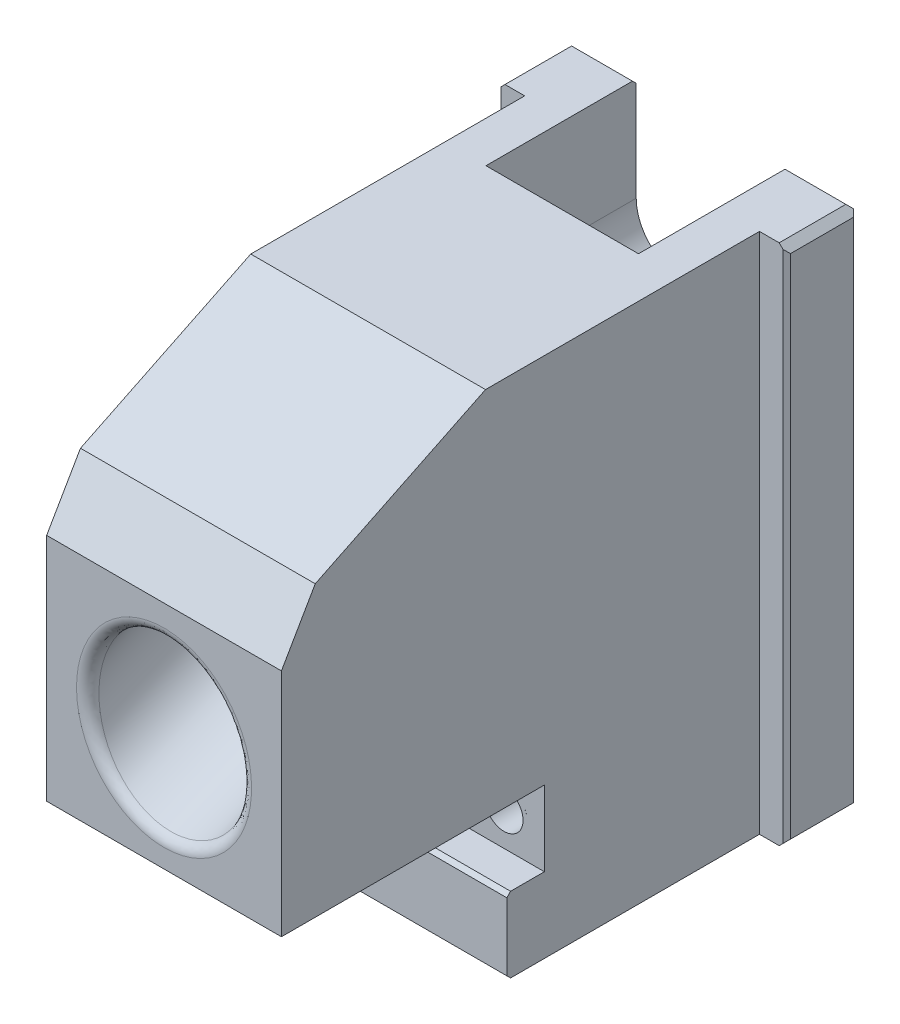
ISO-10303-21;
HEADER;
FILE_DESCRIPTION(('STEP AP214'),'2;1');
FILE_NAME('part.step','',(''),(''),'','','');
FILE_SCHEMA(('AUTOMOTIVE_DESIGN { 1 0 10303 214 1 1 1 1 }'));
ENDSEC;
DATA;
#1=APPLICATION_CONTEXT('core data for automotive mechanical design processes');
#2=APPLICATION_PROTOCOL_DEFINITION('international standard','automotive_design',2000,#1);
#3=PRODUCT_CONTEXT('',#1,'mechanical');
#4=PRODUCT('Part','Part','',(#3));
#5=PRODUCT_RELATED_PRODUCT_CATEGORY('part','',(#4));
#6=PRODUCT_DEFINITION_FORMATION('','',#4);
#7=PRODUCT_DEFINITION_CONTEXT('part definition',#1,'design');
#8=PRODUCT_DEFINITION('design','',#6,#7);
#9=PRODUCT_DEFINITION_SHAPE('','',#8);
#10=(LENGTH_UNIT() NAMED_UNIT(*) SI_UNIT(.MILLI.,.METRE.));
#11=(NAMED_UNIT(*) PLANE_ANGLE_UNIT() SI_UNIT($,.RADIAN.));
#12=(NAMED_UNIT(*) SI_UNIT($,.STERADIAN.) SOLID_ANGLE_UNIT());
#13=UNCERTAINTY_MEASURE_WITH_UNIT(LENGTH_MEASURE(1.E-05),#10,'distance_accuracy_value','');
#14=(GEOMETRIC_REPRESENTATION_CONTEXT(3) GLOBAL_UNCERTAINTY_ASSIGNED_CONTEXT((#13)) GLOBAL_UNIT_ASSIGNED_CONTEXT((#10,
#11,#12)) REPRESENTATION_CONTEXT('',''));
#15=CARTESIAN_POINT('',(0.,0.,0.));
#16=DIRECTION('',(0.,0.,1.));
#17=DIRECTION('',(1.,0.,0.));
#18=AXIS2_PLACEMENT_3D('',#15,#16,#17);
#19=CARTESIAN_POINT('',(103.69282223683,10.16,-17.78));
#20=DIRECTION('',(0.,0.,-1.));
#21=DIRECTION('',(-1.,0.,0.));
#22=AXIS2_PLACEMENT_3D('',#19,#20,#21);
#23=PLANE('',#22);
#24=DIRECTION('',(0.999999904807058,-0.000436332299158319,0.));
#25=VECTOR('',#24,1.);
#26=CARTESIAN_POINT('',(-3.6195001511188,7.36530732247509,-17.78));
#27=LINE('',#26,#25);
#28=CARTESIAN_POINT('',(-3.61924615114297,7.36530721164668,-17.78));
#29=VERTEX_POINT('',#28);
#30=CARTESIAN_POINT('',(-3.6195001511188,7.36530732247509,-17.78));
#31=VERTEX_POINT('',#30);
#32=EDGE_CURVE('E424',#29,#31,#27,.F.);
#33=ORIENTED_EDGE('',*,*,#32,.F.);
#34=CARTESIAN_POINT('',(-5.207,7.366,-17.78));
#35=DIRECTION('',(0.,0.,1.));
#36=DIRECTION('',(1.,0.,0.));
#37=AXIS2_PLACEMENT_3D('',#34,#35,#36);
#38=CIRCLE('',#37,1.587754);
#39=CARTESIAN_POINT('',(-3.619246,7.366,-17.78));
#40=VERTEX_POINT('',#39);
#41=EDGE_CURVE('E376',#40,#29,#38,.T.);
#42=ORIENTED_EDGE('',*,*,#41,.F.);
#43=DIRECTION('',(1.,0.,0.));
#44=VECTOR('',#43,1.);
#45=CARTESIAN_POINT('',(-3.6195,7.366,-17.78));
#46=LINE('',#45,#44);
#47=CARTESIAN_POINT('',(-3.6195,7.366,-17.78));
#48=VERTEX_POINT('',#47);
#49=EDGE_CURVE('E62',#40,#48,#46,.F.);
#50=ORIENTED_EDGE('',*,*,#49,.T.);
#51=CARTESIAN_POINT('',(-5.207,7.366,-17.78));
#52=DIRECTION('',(0.,0.,1.));
#53=DIRECTION('',(1.,0.,0.));
#54=AXIS2_PLACEMENT_3D('',#51,#52,#53);
#55=CIRCLE('',#54,1.5875);
#56=EDGE_CURVE('E405',#48,#31,#55,.T.);
#57=ORIENTED_EDGE('',*,*,#56,.T.);
#58=EDGE_LOOP('',(#33,#42,#50,#57));
#59=FACE_BOUND('',#58,.T.);
#60=CARTESIAN_POINT('',(5.207,7.366,-17.78));
#61=DIRECTION('',(0.,0.,-1.));
#62=DIRECTION('',(-1.,0.,0.));
#63=AXIS2_PLACEMENT_3D('',#60,#61,#62);
#64=CIRCLE('',#63,1.28905);
#65=CARTESIAN_POINT('',(3.91795,7.366,-17.78));
#66=VERTEX_POINT('',#65);
#67=EDGE_CURVE('E1458',#66,#66,#64,.T.);
#68=ORIENTED_EDGE('',*,*,#67,.T.);
#69=EDGE_LOOP('',(#68));
#70=FACE_BOUND('',#69,.T.);
#71=CARTESIAN_POINT('',(-5.207,7.366,-17.78));
#72=DIRECTION('',(0.,0.,-1.));
#73=DIRECTION('',(-1.,0.,0.));
#74=AXIS2_PLACEMENT_3D('',#71,#72,#73);
#75=CIRCLE('',#74,1.28905);
#76=CARTESIAN_POINT('',(-6.49605,7.366,-17.78));
#77=VERTEX_POINT('',#76);
#78=EDGE_CURVE('E1454',#77,#77,#75,.T.);
#79=ORIENTED_EDGE('',*,*,#78,.T.);
#80=EDGE_LOOP('',(#79));
#81=FACE_BOUND('',#80,.T.);
#82=DIRECTION('',(-1.,0.,0.));
#83=VECTOR('',#82,1.);
#84=CARTESIAN_POINT('',(103.69282223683,10.16,-17.78));
#85=LINE('',#84,#83);
#86=CARTESIAN_POINT('',(7.9375,10.16,-17.78));
#87=VERTEX_POINT('',#86);
#88=CARTESIAN_POINT('',(-7.9375,10.16,-17.78));
#89=VERTEX_POINT('',#88);
#90=EDGE_CURVE('E1488',#87,#89,#85,.T.);
#91=ORIENTED_EDGE('',*,*,#90,.T.);
#92=DIRECTION('',(0.,-1.,0.));
#93=VECTOR('',#92,1.);
#94=CARTESIAN_POINT('',(-7.9375,35.306,-17.78));
#95=LINE('',#94,#93);
#96=CARTESIAN_POINT('',(-7.9375,5.08,-17.78));
#97=VERTEX_POINT('',#96);
#98=EDGE_CURVE('E1435',#89,#97,#95,.T.);
#99=ORIENTED_EDGE('',*,*,#98,.T.);
#100=DIRECTION('',(-1.,0.,0.));
#101=VECTOR('',#100,1.);
#102=CARTESIAN_POINT('',(103.69282223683,5.08,-17.78));
#103=LINE('',#102,#101);
#104=CARTESIAN_POINT('',(7.9375,5.08,-17.78));
#105=VERTEX_POINT('',#104);
#106=EDGE_CURVE('E1457',#105,#97,#103,.T.);
#107=ORIENTED_EDGE('',*,*,#106,.F.);
#108=DIRECTION('',(0.,1.,0.));
#109=VECTOR('',#108,1.);
#110=CARTESIAN_POINT('',(7.9375,35.306,-17.78));
#111=LINE('',#110,#109);
#112=EDGE_CURVE('E1450',#105,#87,#111,.T.);
#113=ORIENTED_EDGE('',*,*,#112,.T.);
#114=EDGE_LOOP('',(#91,#99,#107,#113));
#115=FACE_BOUND('',#114,.T.);
#116=DIRECTION('',(0.999999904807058,-0.000436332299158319,0.));
#117=VECTOR('',#116,1.);
#118=CARTESIAN_POINT('',(6.7944998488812,7.36530732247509,-17.78));
#119=LINE('',#118,#117);
#120=CARTESIAN_POINT('',(6.79475384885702,7.36530721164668,-17.78));
#121=VERTEX_POINT('',#120);
#122=CARTESIAN_POINT('',(6.7944998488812,7.36530732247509,-17.78));
#123=VERTEX_POINT('',#122);
#124=EDGE_CURVE('E367',#121,#123,#119,.F.);
#125=ORIENTED_EDGE('',*,*,#124,.F.);
#126=CARTESIAN_POINT('',(5.207,7.366,-17.78));
#127=DIRECTION('',(0.,0.,1.));
#128=DIRECTION('',(1.,0.,0.));
#129=AXIS2_PLACEMENT_3D('',#126,#127,#128);
#130=CIRCLE('',#129,1.587754);
#131=CARTESIAN_POINT('',(6.794754,7.366,-17.78));
#132=VERTEX_POINT('',#131);
#133=EDGE_CURVE('E1502',#132,#121,#130,.T.);
#134=ORIENTED_EDGE('',*,*,#133,.F.);
#135=DIRECTION('',(1.,0.,0.));
#136=VECTOR('',#135,1.);
#137=CARTESIAN_POINT('',(6.7945,7.366,-17.78));
#138=LINE('',#137,#136);
#139=CARTESIAN_POINT('',(6.7945,7.366,-17.78));
#140=VERTEX_POINT('',#139);
#141=EDGE_CURVE('E54',#132,#140,#138,.F.);
#142=ORIENTED_EDGE('',*,*,#141,.T.);
#143=CARTESIAN_POINT('',(5.207,7.366,-17.78));
#144=DIRECTION('',(0.,0.,1.));
#145=DIRECTION('',(1.,0.,0.));
#146=AXIS2_PLACEMENT_3D('',#143,#144,#145);
#147=CIRCLE('',#146,1.5875);
#148=EDGE_CURVE('E1504',#140,#123,#147,.T.);
#149=ORIENTED_EDGE('',*,*,#148,.T.);
#150=EDGE_LOOP('',(#125,#134,#142,#149));
#151=FACE_BOUND('',#150,.T.);
#152=ADVANCED_FACE('F39',(#59,#70,#81,#115,#151),#23,.F.);
#153=CARTESIAN_POINT('',(0.,108.825108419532,-215.087235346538));
#154=DIRECTION('',(0.,-0.390731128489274,0.92050485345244));
#155=DIRECTION('',(0.,-0.92050485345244,-0.390731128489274));
#156=AXIS2_PLACEMENT_3D('',#153,#154,#155);
#157=CYLINDRICAL_SURFACE('',#156,5.1562);
#158=CARTESIAN_POINT('',(0.,17.8494435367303,-0.762000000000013));
#159=DIRECTION('',(0.,-0.0519103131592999,-0.998651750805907));
#160=DIRECTION('',(0.,-0.998651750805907,0.0519103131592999));
#161=AXIS2_PLACEMENT_3D('',#158,#159,#160);
#162=ELLIPSE('',#161,5.7356063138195,5.1562);
#163=CARTESIAN_POINT('',(0.,12.1215702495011,-0.464262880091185));
#164=VERTEX_POINT('',#163);
#165=EDGE_CURVE('E1405',#164,#164,#162,.F.);
#166=ORIENTED_EDGE('',*,*,#165,.T.);
#167=EDGE_LOOP('',(#166));
#168=FACE_BOUND('',#167,.T.);
#169=CARTESIAN_POINT('',(0.,28.954553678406,-26.924));
#170=DIRECTION('',(0.,0.,-1.));
#171=DIRECTION('',(0.,-1.,0.));
#172=AXIS2_PLACEMENT_3D('',#169,#170,#171);
#173=ELLIPSE('',#172,5.60149137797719,5.1562);
#174=CARTESIAN_POINT('',(5.1562,28.954553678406,-26.924));
#175=VERTEX_POINT('',#174);
#176=CARTESIAN_POINT('',(-5.1562,28.954553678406,-26.924));
#177=VERTEX_POINT('',#176);
#178=EDGE_CURVE('E444',#175,#177,#173,.F.);
#179=ORIENTED_EDGE('',*,*,#178,.F.);
#180=CARTESIAN_POINT('',(4.73959602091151,26.7487797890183,-26.924));
#181=VERTEX_POINT('',#180);
#182=EDGE_CURVE('E1292',#181,#175,#173,.F.);
#183=ORIENTED_EDGE('',*,*,#182,.F.);
#184=CARTESIAN_POINT('',(4.73959602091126,26.7487797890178,-26.924));
#185=CARTESIAN_POINT('',(4.67914446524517,26.642636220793,-27.0353528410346));
#186=CARTESIAN_POINT('',(4.61255122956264,26.5401159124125,-27.1468055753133));
#187=CARTESIAN_POINT('',(4.46824754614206,26.3436273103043,-27.3700026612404));
#188=CARTESIAN_POINT('',(4.39053946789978,26.2496572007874,-27.4817469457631));
#189=CARTESIAN_POINT('',(4.22539246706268,26.0717941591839,-27.7053319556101));
#190=CARTESIAN_POINT('',(4.13798329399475,25.9878719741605,-27.8171713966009));
#191=CARTESIAN_POINT('',(3.95461289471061,25.8308532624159,-28.0414258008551));
#192=CARTESIAN_POINT('',(3.85865190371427,25.7577564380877,-28.153840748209));
#193=CARTESIAN_POINT('',(3.65921820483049,25.6229573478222,-28.3799501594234));
#194=CARTESIAN_POINT('',(3.55571270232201,25.5613095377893,-28.4936481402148));
#195=CARTESIAN_POINT('',(3.34324014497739,25.4504899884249,-28.7220189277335));
#196=CARTESIAN_POINT('',(3.23427290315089,25.4013186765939,-28.8366917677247));
#197=CARTESIAN_POINT('',(3.01273238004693,25.3158962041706,-29.0671311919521));
#198=CARTESIAN_POINT('',(2.90016246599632,25.2796333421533,-29.1828966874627));
#199=CARTESIAN_POINT('',(2.673145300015,25.2200970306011,-29.4158337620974));
#200=CARTESIAN_POINT('',(2.55869879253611,25.1968185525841,-29.53300477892));
#201=CARTESIAN_POINT('',(2.36668396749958,25.168513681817,-29.7308904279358));
#202=CARTESIAN_POINT('',(2.28914404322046,25.1600204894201,-29.8111561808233));
#203=CARTESIAN_POINT('',(2.13464034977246,25.1487635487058,-29.9724200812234));
#204=CARTESIAN_POINT('',(2.05767591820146,25.1459916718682,-30.053417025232));
#205=CARTESIAN_POINT('',(1.9812,25.146,-30.1348798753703));
#206=B_SPLINE_CURVE_WITH_KNOTS('',3,(#184,#185,#186,#187,#188,#189,#190,#191,#192,#193,#194,
#195,#196,#197,#198,#199,#200,#201,#202,#203,#204,#205),.UNSPECIFIED.,.F.,.F.,(4,2,2,2,2,2,2,2,
2,2,4),(0.,0.495696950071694,0.991288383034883,1.48539996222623,1.97949795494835,
2.47588902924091,2.97229710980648,3.46825404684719,3.96401878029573,4.29965205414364,
4.63480815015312),.UNSPECIFIED.);
#207=CARTESIAN_POINT('',(1.98119999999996,25.146,-30.1348798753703));
#208=VERTEX_POINT('',#207);
#209=EDGE_CURVE('E1284',#181,#208,#206,.T.);
#210=ORIENTED_EDGE('',*,*,#209,.T.);
#211=CARTESIAN_POINT('',(0.,25.146,-17.9516098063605));
#212=DIRECTION('',(0.,-1.,0.));
#213=DIRECTION('',(0.,0.,1.));
#214=AXIS2_PLACEMENT_3D('',#211,#212,#213);
#215=ELLIPSE('',#214,13.1962867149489,5.1562);
#216=CARTESIAN_POINT('',(-1.9812,25.146,-30.1348798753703));
#217=VERTEX_POINT('',#216);
#218=EDGE_CURVE('E1296',#208,#217,#215,.F.);
#219=ORIENTED_EDGE('',*,*,#218,.T.);
#220=CARTESIAN_POINT('',(-1.9812,25.146,-30.1348798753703));
#221=CARTESIAN_POINT('',(-2.04227217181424,25.145997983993,-30.0698274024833));
#222=CARTESIAN_POINT('',(-2.10365074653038,25.1477627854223,-30.0050748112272));
#223=CARTESIAN_POINT('',(-2.22677298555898,25.1549108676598,-29.87611573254));
#224=CARTESIAN_POINT('',(-2.28851666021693,25.1602942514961,-29.8119092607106));
#225=CARTESIAN_POINT('',(-2.47393094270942,25.1820008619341,-29.6200211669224));
#226=CARTESIAN_POINT('',(-2.59777239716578,25.2038805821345,-29.4930839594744));
#227=CARTESIAN_POINT('',(-2.84388775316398,25.2628227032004,-29.2406833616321));
#228=CARTESIAN_POINT('',(-2.96615757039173,25.2999186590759,-29.1152238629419));
#229=CARTESIAN_POINT('',(-3.20657259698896,25.38918787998,-28.865761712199));
#230=CARTESIAN_POINT('',(-3.32471871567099,25.4413577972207,-28.7417587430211));
#231=CARTESIAN_POINT('',(-3.55422252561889,25.5600493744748,-28.4954028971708));
#232=CARTESIAN_POINT('',(-3.66560611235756,25.6265111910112,-28.3730453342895));
#233=CARTESIAN_POINT('',(-3.88004152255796,25.7730813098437,-28.1292070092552));
#234=CARTESIAN_POINT('',(-3.9830937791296,25.8531889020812,-28.0077262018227));
#235=CARTESIAN_POINT('',(-4.17862976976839,26.0255997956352,-27.765853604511));
#236=CARTESIAN_POINT('',(-4.27114973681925,26.1178587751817,-27.6454594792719));
#237=CARTESIAN_POINT('',(-4.4443389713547,26.3133636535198,-27.405200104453));
#238=CARTESIAN_POINT('',(-4.52501674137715,26.4166015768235,-27.2853345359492));
#239=CARTESIAN_POINT('',(-4.6240263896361,26.5608737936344,-27.1253503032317));
#240=CARTESIAN_POINT('',(-4.64823116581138,26.5977706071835,-27.0850468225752));
#241=CARTESIAN_POINT('',(-4.69508552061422,26.6725479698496,-27.0044925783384));
#242=CARTESIAN_POINT('',(-4.71773586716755,26.7104280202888,-26.964241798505));
#243=CARTESIAN_POINT('',(-4.73959602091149,26.7487797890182,-26.9240000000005));
#244=B_SPLINE_CURVE_WITH_KNOTS('',3,(#220,#221,#222,#223,#224,#225,#226,#227,#228,#229,#230,
#231,#232,#233,#234,#235,#236,#237,#238,#239,#240,#241,#242,#243),.UNSPECIFIED.,.F.,.F.,(4,2,2,
2,2,2,2,2,2,2,2,4),(0.,0.26764655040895,0.53530072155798,1.0706630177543,1.60721230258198,
2.14364251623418,2.6778688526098,3.21206739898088,3.7443688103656,4.2762861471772,
4.45555442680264,4.6347334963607),.UNSPECIFIED.);
#245=CARTESIAN_POINT('',(-4.73959602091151,26.7487797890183,-26.924));
#246=VERTEX_POINT('',#245);
#247=EDGE_CURVE('E1300',#217,#246,#244,.T.);
#248=ORIENTED_EDGE('',*,*,#247,.T.);
#249=EDGE_CURVE('E1297',#177,#246,#173,.F.);
#250=ORIENTED_EDGE('',*,*,#249,.F.);
#251=EDGE_LOOP('',(#179,#183,#210,#219,#248,#250));
#252=FACE_BOUND('',#251,.T.);
#253=ADVANCED_FACE('F608',(#168,#252),#157,.F.);
#254=CARTESIAN_POINT('',(7.9375,35.306,-32.3088));
#255=DIRECTION('',(0.,-1.,0.));
#256=DIRECTION('',(0.,0.,-1.));
#257=AXIS2_PLACEMENT_3D('',#254,#255,#256);
#258=PLANE('',#257);
#259=DIRECTION('',(-1.,0.,0.));
#260=VECTOR('',#259,1.);
#261=CARTESIAN_POINT('',(-9.779,35.306,-36.83));
#262=LINE('',#261,#260);
#263=CARTESIAN_POINT('',(-5.1562,35.306,-36.83));
#264=VERTEX_POINT('',#263);
#265=CARTESIAN_POINT('',(-9.271,35.306,-36.83));
#266=VERTEX_POINT('',#265);
#267=EDGE_CURVE('E447',#264,#266,#262,.T.);
#268=ORIENTED_EDGE('',*,*,#267,.T.);
#269=DIRECTION('',(0.,0.,1.));
#270=VECTOR('',#269,1.);
#271=CARTESIAN_POINT('',(-9.271,35.306,-32.32404));
#272=LINE('',#271,#270);
#273=CARTESIAN_POINT('',(-9.271,35.306,-32.32404));
#274=VERTEX_POINT('',#273);
#275=EDGE_CURVE('E490',#266,#274,#272,.T.);
#276=ORIENTED_EDGE('',*,*,#275,.T.);
#277=DIRECTION('',(-1.,0.,0.));
#278=VECTOR('',#277,1.);
#279=CARTESIAN_POINT('',(7.9375,35.306,-32.32404));
#280=LINE('',#279,#278);
#281=CARTESIAN_POINT('',(-7.9375,35.306,-32.32404));
#282=VERTEX_POINT('',#281);
#283=EDGE_CURVE('E1395',#282,#274,#280,.T.);
#284=ORIENTED_EDGE('',*,*,#283,.F.);
#285=DIRECTION('',(0.,0.,-1.));
#286=VECTOR('',#285,1.);
#287=CARTESIAN_POINT('',(-7.9375,35.306,0.));
#288=LINE('',#287,#286);
#289=CARTESIAN_POINT('',(-7.9375,35.306,-13.7994304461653));
#290=VERTEX_POINT('',#289);
#291=EDGE_CURVE('E1384',#290,#282,#288,.T.);
#292=ORIENTED_EDGE('',*,*,#291,.F.);
#293=DIRECTION('',(-1.,0.,0.));
#294=VECTOR('',#293,1.);
#295=CARTESIAN_POINT('',(103.69282223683,35.306,-13.7994304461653));
#296=LINE('',#295,#294);
#297=CARTESIAN_POINT('',(7.9375,35.306,-13.7994304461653));
#298=VERTEX_POINT('',#297);
#299=EDGE_CURVE('E1432',#298,#290,#296,.T.);
#300=ORIENTED_EDGE('',*,*,#299,.F.);
#301=DIRECTION('',(0.,0.,1.));
#302=VECTOR('',#301,1.);
#303=CARTESIAN_POINT('',(7.9375,35.306,-32.3088));
#304=LINE('',#303,#302);
#305=CARTESIAN_POINT('',(7.9375,35.306,-32.32404));
#306=VERTEX_POINT('',#305);
#307=EDGE_CURVE('E1381',#306,#298,#304,.T.);
#308=ORIENTED_EDGE('',*,*,#307,.F.);
#309=DIRECTION('',(-1.,0.,0.));
#310=VECTOR('',#309,1.);
#311=CARTESIAN_POINT('',(7.9375,35.306,-32.32404));
#312=LINE('',#311,#310);
#313=CARTESIAN_POINT('',(9.271,35.306,-32.32404));
#314=VERTEX_POINT('',#313);
#315=EDGE_CURVE('E1393',#314,#306,#312,.T.);
#316=ORIENTED_EDGE('',*,*,#315,.F.);
#317=DIRECTION('',(0.,0.,-1.));
#318=VECTOR('',#317,1.);
#319=CARTESIAN_POINT('',(9.271,35.306,-36.83));
#320=LINE('',#319,#318);
#321=CARTESIAN_POINT('',(9.271,35.306,-36.83));
#322=VERTEX_POINT('',#321);
#323=EDGE_CURVE('E488',#314,#322,#320,.T.);
#324=ORIENTED_EDGE('',*,*,#323,.T.);
#325=DIRECTION('',(-1.,0.,0.));
#326=VECTOR('',#325,1.);
#327=CARTESIAN_POINT('',(5.1562,35.306,-36.83));
#328=LINE('',#327,#326);
#329=CARTESIAN_POINT('',(5.1562,35.306,-36.83));
#330=VERTEX_POINT('',#329);
#331=EDGE_CURVE('E450',#322,#330,#328,.T.);
#332=ORIENTED_EDGE('',*,*,#331,.T.);
#333=DIRECTION('',(0.,0.,-1.));
#334=VECTOR('',#333,1.);
#335=CARTESIAN_POINT('',(5.1562,35.306,-26.924));
#336=LINE('',#335,#334);
#337=CARTESIAN_POINT('',(5.1562,35.306,-26.924));
#338=VERTEX_POINT('',#337);
#339=EDGE_CURVE('E1311',#338,#330,#336,.T.);
#340=ORIENTED_EDGE('',*,*,#339,.F.);
#341=DIRECTION('',(1.,0.,0.));
#342=VECTOR('',#341,1.);
#343=CARTESIAN_POINT('',(-5.1562,35.306,-26.924));
#344=LINE('',#343,#342);
#345=CARTESIAN_POINT('',(-5.1562,35.306,-26.924));
#346=VERTEX_POINT('',#345);
#347=EDGE_CURVE('E1335',#346,#338,#344,.T.);
#348=ORIENTED_EDGE('',*,*,#347,.F.);
#349=DIRECTION('',(0.,0.,-1.));
#350=VECTOR('',#349,1.);
#351=CARTESIAN_POINT('',(-5.1562,35.306,-26.924));
#352=LINE('',#351,#350);
#353=EDGE_CURVE('E1307',#346,#264,#352,.T.);
#354=ORIENTED_EDGE('',*,*,#353,.T.);
#355=EDGE_LOOP('',(#268,#276,#284,#292,#300,#308,#316,#324,#332,#340,#348,#354));
#356=FACE_BOUND('',#355,.T.);
#357=ADVANCED_FACE('F649',(#356),#258,.F.);
#358=CARTESIAN_POINT('',(7.9375,0.,-32.3088));
#359=DIRECTION('',(0.,-1.,0.));
#360=DIRECTION('',(0.,0.,-1.));
#361=AXIS2_PLACEMENT_3D('',#358,#359,#360);
#362=PLANE('',#361);
#363=DIRECTION('',(-1.,0.,0.));
#364=VECTOR('',#363,1.);
#365=CARTESIAN_POINT('',(7.9375,0.,-32.32404));
#366=LINE('',#365,#364);
#367=CARTESIAN_POINT('',(-7.9375,0.,-32.32404));
#368=VERTEX_POINT('',#367);
#369=CARTESIAN_POINT('',(-9.271,0.,-32.32404));
#370=VERTEX_POINT('',#369);
#371=EDGE_CURVE('E1370',#368,#370,#366,.T.);
#372=ORIENTED_EDGE('',*,*,#371,.T.);
#373=DIRECTION('',(0.,0.,-1.));
#374=VECTOR('',#373,1.);
#375=CARTESIAN_POINT('',(-9.271,0.,-32.3088));
#376=LINE('',#375,#374);
#377=CARTESIAN_POINT('',(-9.271,0.,-36.83));
#378=VERTEX_POINT('',#377);
#379=EDGE_CURVE('E514',#370,#378,#376,.T.);
#380=ORIENTED_EDGE('',*,*,#379,.T.);
#381=DIRECTION('',(1.,0.,0.));
#382=VECTOR('',#381,1.);
#383=CARTESIAN_POINT('',(7.9375,0.,-36.83));
#384=LINE('',#383,#382);
#385=CARTESIAN_POINT('',(9.271,0.,-36.83));
#386=VERTEX_POINT('',#385);
#387=EDGE_CURVE('E462',#378,#386,#384,.T.);
#388=ORIENTED_EDGE('',*,*,#387,.T.);
#389=DIRECTION('',(0.,0.,1.));
#390=VECTOR('',#389,1.);
#391=CARTESIAN_POINT('',(9.271,0.,-32.3088));
#392=LINE('',#391,#390);
#393=CARTESIAN_POINT('',(9.271,0.,-32.32404));
#394=VERTEX_POINT('',#393);
#395=EDGE_CURVE('E511',#386,#394,#392,.T.);
#396=ORIENTED_EDGE('',*,*,#395,.T.);
#397=DIRECTION('',(-1.,0.,0.));
#398=VECTOR('',#397,1.);
#399=CARTESIAN_POINT('',(7.9375,0.,-32.32404));
#400=LINE('',#399,#398);
#401=CARTESIAN_POINT('',(7.9375,0.,-32.32404));
#402=VERTEX_POINT('',#401);
#403=EDGE_CURVE('E1375',#394,#402,#400,.T.);
#404=ORIENTED_EDGE('',*,*,#403,.T.);
#405=DIRECTION('',(0.,0.,1.));
#406=VECTOR('',#405,1.);
#407=CARTESIAN_POINT('',(7.9375,0.,-32.3088));
#408=LINE('',#407,#406);
#409=CARTESIAN_POINT('',(7.9375,0.,-15.494));
#410=VERTEX_POINT('',#409);
#411=EDGE_CURVE('E1434',#402,#410,#408,.T.);
#412=ORIENTED_EDGE('',*,*,#411,.T.);
#413=DIRECTION('',(-1.,0.,0.));
#414=VECTOR('',#413,1.);
#415=CARTESIAN_POINT('',(-7.9375,0.,-15.494));
#416=LINE('',#415,#414);
#417=CARTESIAN_POINT('',(-7.9375,0.,-15.494));
#418=VERTEX_POINT('',#417);
#419=EDGE_CURVE('E459',#410,#418,#416,.T.);
#420=ORIENTED_EDGE('',*,*,#419,.T.);
#421=DIRECTION('',(0.,0.,-1.));
#422=VECTOR('',#421,1.);
#423=CARTESIAN_POINT('',(-7.9375,0.,0.));
#424=LINE('',#423,#422);
#425=EDGE_CURVE('E1386',#418,#368,#424,.T.);
#426=ORIENTED_EDGE('',*,*,#425,.T.);
#427=EDGE_LOOP('',(#372,#380,#388,#396,#404,#412,#420,#426));
#428=FACE_BOUND('',#427,.T.);
#429=ADVANCED_FACE('F664',(#428),#362,.T.);
#430=CARTESIAN_POINT('',(-7.9375,35.306,0.));
#431=DIRECTION('',(-1.,0.,0.));
#432=DIRECTION('',(0.,0.,1.));
#433=AXIS2_PLACEMENT_3D('',#430,#431,#432);
#434=PLANE('',#433);
#435=ORIENTED_EDGE('',*,*,#425,.F.);
#436=DIRECTION('',(0.,0.707106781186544,0.707106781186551));
#437=VECTOR('',#436,1.);
#438=CARTESIAN_POINT('',(-7.9375,25.4,9.906));
#439=LINE('',#438,#437);
#440=CARTESIAN_POINT('',(-7.9375,0.254,-15.24));
#441=VERTEX_POINT('',#440);
#442=EDGE_CURVE('E467',#418,#441,#439,.T.);
#443=ORIENTED_EDGE('',*,*,#442,.T.);
#444=DIRECTION('',(0.,-1.,0.));
#445=VECTOR('',#444,1.);
#446=CARTESIAN_POINT('',(-7.9375,35.306,-15.24));
#447=LINE('',#446,#445);
#448=CARTESIAN_POINT('',(-7.9375,4.826,-15.24));
#449=VERTEX_POINT('',#448);
#450=EDGE_CURVE('E1471',#449,#441,#447,.T.);
#451=ORIENTED_EDGE('',*,*,#450,.F.);
#452=DIRECTION('',(0.,-0.707106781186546,0.707106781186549));
#453=VECTOR('',#452,1.);
#454=CARTESIAN_POINT('',(-7.9375,12.446,-22.86));
#455=LINE('',#454,#453);
#456=CARTESIAN_POINT('',(-7.9375,5.08,-15.494));
#457=VERTEX_POINT('',#456);
#458=EDGE_CURVE('E465',#449,#457,#455,.F.);
#459=ORIENTED_EDGE('',*,*,#458,.T.);
#460=DIRECTION('',(0.,0.,1.));
#461=VECTOR('',#460,1.);
#462=CARTESIAN_POINT('',(-7.9375,5.08,0.));
#463=LINE('',#462,#461);
#464=EDGE_CURVE('E1439',#97,#457,#463,.T.);
#465=ORIENTED_EDGE('',*,*,#464,.F.);
#466=ORIENTED_EDGE('',*,*,#98,.F.);
#467=DIRECTION('',(0.,0.,-1.));
#468=VECTOR('',#467,1.);
#469=CARTESIAN_POINT('',(-7.9375,10.16,0.));
#470=LINE('',#469,#468);
#471=CARTESIAN_POINT('',(-7.9375,10.16,0.));
#472=VERTEX_POINT('',#471);
#473=EDGE_CURVE('E1479',#472,#89,#470,.T.);
#474=ORIENTED_EDGE('',*,*,#473,.F.);
#475=DIRECTION('',(0.,-1.,0.));
#476=VECTOR('',#475,1.);
#477=CARTESIAN_POINT('',(-7.9375,35.306,0.));
#478=LINE('',#477,#476);
#479=CARTESIAN_POINT('',(-7.9375,25.7314700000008,0.));
#480=VERTEX_POINT('',#479);
#481=EDGE_CURVE('E1421',#480,#472,#478,.T.);
#482=ORIENTED_EDGE('',*,*,#481,.F.);
#483=DIRECTION('',(0.,0.866025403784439,-0.5));
#484=VECTOR('',#483,1.);
#485=CARTESIAN_POINT('',(-7.9375,32.9123675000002,-4.14589310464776));
#486=LINE('',#485,#484);
#487=CARTESIAN_POINT('',(-7.9375,29.6903627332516,-2.28566778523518));
#488=VERTEX_POINT('',#487);
#489=EDGE_CURVE('E1399',#480,#488,#486,.T.);
#490=ORIENTED_EDGE('',*,*,#489,.T.);
#491=DIRECTION('',(0.,-0.438371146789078,0.898794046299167));
#492=VECTOR('',#491,1.);
#493=CARTESIAN_POINT('',(-7.9375,29.8689502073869,-2.65182636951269));
#494=LINE('',#493,#492);
#495=EDGE_CURVE('E1427',#290,#488,#494,.T.);
#496=ORIENTED_EDGE('',*,*,#495,.F.);
#497=ORIENTED_EDGE('',*,*,#291,.T.);
#498=DIRECTION('',(0.,-1.,0.));
#499=VECTOR('',#498,1.);
#500=CARTESIAN_POINT('',(-7.9375,35.306,-32.32404));
#501=LINE('',#500,#499);
#502=EDGE_CURVE('E1390',#282,#368,#501,.T.);
#503=ORIENTED_EDGE('',*,*,#502,.T.);
#504=EDGE_LOOP('',(#435,#443,#451,#459,#465,#466,#474,#482,#490,#496,#497,#503));
#505=FACE_BOUND('',#504,.T.);
#506=ADVANCED_FACE('F619',(#505),#434,.T.);
#507=CARTESIAN_POINT('',(7.9375,35.306,-32.3088));
#508=DIRECTION('',(1.,0.,0.));
#509=DIRECTION('',(0.,0.,-1.));
#510=AXIS2_PLACEMENT_3D('',#507,#508,#509);
#511=PLANE('',#510);
#512=DIRECTION('',(0.,1.,0.));
#513=VECTOR('',#512,1.);
#514=CARTESIAN_POINT('',(7.9375,35.306,-15.24));
#515=LINE('',#514,#513);
#516=CARTESIAN_POINT('',(7.9375,0.253999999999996,-15.24));
#517=VERTEX_POINT('',#516);
#518=CARTESIAN_POINT('',(7.9375,4.826,-15.24));
#519=VERTEX_POINT('',#518);
#520=EDGE_CURVE('E1420',#517,#519,#515,.T.);
#521=ORIENTED_EDGE('',*,*,#520,.F.);
#522=DIRECTION('',(0.,-0.707106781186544,-0.707106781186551));
#523=VECTOR('',#522,1.);
#524=CARTESIAN_POINT('',(7.9375,9.24559999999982,-6.24840000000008));
#525=LINE('',#524,#523);
#526=EDGE_CURVE('E475',#517,#410,#525,.T.);
#527=ORIENTED_EDGE('',*,*,#526,.T.);
#528=ORIENTED_EDGE('',*,*,#411,.F.);
#529=DIRECTION('',(0.,-1.,0.));
#530=VECTOR('',#529,1.);
#531=CARTESIAN_POINT('',(7.9375,35.306,-32.32404));
#532=LINE('',#531,#530);
#533=EDGE_CURVE('E1380',#306,#402,#532,.T.);
#534=ORIENTED_EDGE('',*,*,#533,.F.);
#535=ORIENTED_EDGE('',*,*,#307,.T.);
#536=DIRECTION('',(0.,0.438371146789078,-0.898794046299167));
#537=VECTOR('',#536,1.);
#538=CARTESIAN_POINT('',(7.9375,42.5987911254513,-28.7518681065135));
#539=LINE('',#538,#537);
#540=CARTESIAN_POINT('',(7.9375,29.6903627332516,-2.28566778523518));
#541=VERTEX_POINT('',#540);
#542=EDGE_CURVE('E1400',#541,#298,#539,.T.);
#543=ORIENTED_EDGE('',*,*,#542,.F.);
#544=DIRECTION('',(0.,-0.866025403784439,0.5));
#545=VECTOR('',#544,1.);
#546=CARTESIAN_POINT('',(7.9375,46.9024882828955,-12.2230931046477));
#547=LINE('',#546,#545);
#548=CARTESIAN_POINT('',(7.9375,25.7314700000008,0.));
#549=VERTEX_POINT('',#548);
#550=EDGE_CURVE('E1404',#541,#549,#547,.T.);
#551=ORIENTED_EDGE('',*,*,#550,.T.);
#552=DIRECTION('',(0.,-1.,0.));
#553=VECTOR('',#552,1.);
#554=CARTESIAN_POINT('',(7.9375,35.306,0.));
#555=LINE('',#554,#553);
#556=CARTESIAN_POINT('',(7.9375,10.16,0.));
#557=VERTEX_POINT('',#556);
#558=EDGE_CURVE('E1414',#549,#557,#555,.T.);
#559=ORIENTED_EDGE('',*,*,#558,.T.);
#560=DIRECTION('',(0.,0.,1.));
#561=VECTOR('',#560,1.);
#562=CARTESIAN_POINT('',(7.9375,10.16,-32.3088));
#563=LINE('',#562,#561);
#564=EDGE_CURVE('E1484',#87,#557,#563,.T.);
#565=ORIENTED_EDGE('',*,*,#564,.F.);
#566=ORIENTED_EDGE('',*,*,#112,.F.);
#567=DIRECTION('',(0.,0.,-1.));
#568=VECTOR('',#567,1.);
#569=CARTESIAN_POINT('',(7.9375,5.08,-32.3088));
#570=LINE('',#569,#568);
#571=CARTESIAN_POINT('',(7.9375,5.08,-15.494));
#572=VERTEX_POINT('',#571);
#573=EDGE_CURVE('E1448',#572,#105,#570,.T.);
#574=ORIENTED_EDGE('',*,*,#573,.F.);
#575=DIRECTION('',(0.,0.707106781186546,-0.707106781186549));
#576=VECTOR('',#575,1.);
#577=CARTESIAN_POINT('',(7.9375,28.6004,-39.0144));
#578=LINE('',#577,#576);
#579=EDGE_CURVE('E473',#572,#519,#578,.F.);
#580=ORIENTED_EDGE('',*,*,#579,.T.);
#581=EDGE_LOOP('',(#521,#527,#528,#534,#535,#543,#551,#559,#565,#566,#574,#580));
#582=FACE_BOUND('',#581,.T.);
#583=ADVANCED_FACE('F617',(#582),#511,.T.);
#584=CARTESIAN_POINT('',(7.9375,35.306,0.));
#585=DIRECTION('',(0.,0.,1.));
#586=DIRECTION('',(1.,0.,0.));
#587=AXIS2_PLACEMENT_3D('',#584,#585,#586);
#588=PLANE('',#587);
#589=CARTESIAN_POINT('',(0.,17.8494435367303,0.));
#590=DIRECTION('',(0.,0.,1.));
#591=DIRECTION('',(0.,-1.,0.));
#592=AXIS2_PLACEMENT_3D('',#589,#590,#591);
#593=ELLIPSE('',#592,6.42929798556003,5.9182);
#594=CARTESIAN_POINT('',(0.,11.4201455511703,0.));
#595=VERTEX_POINT('',#594);
#596=EDGE_CURVE('E1293',#595,#595,#593,.F.);
#597=ORIENTED_EDGE('',*,*,#596,.T.);
#598=EDGE_LOOP('',(#597));
#599=FACE_BOUND('',#598,.T.);
#600=ORIENTED_EDGE('',*,*,#558,.F.);
#601=DIRECTION('',(-1.,0.,0.));
#602=VECTOR('',#601,1.);
#603=CARTESIAN_POINT('',(-7.9375,25.7314700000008,0.));
#604=LINE('',#603,#602);
#605=EDGE_CURVE('E1396',#549,#480,#604,.T.);
#606=ORIENTED_EDGE('',*,*,#605,.T.);
#607=ORIENTED_EDGE('',*,*,#481,.T.);
#608=DIRECTION('',(-1.,0.,0.));
#609=VECTOR('',#608,1.);
#610=CARTESIAN_POINT('',(103.69282223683,10.16,0.));
#611=LINE('',#610,#609);
#612=EDGE_CURVE('E1418',#557,#472,#611,.T.);
#613=ORIENTED_EDGE('',*,*,#612,.F.);
#614=EDGE_LOOP('',(#600,#606,#607,#613));
#615=FACE_BOUND('',#614,.T.);
#616=ADVANCED_FACE('F611',(#599,#615),#588,.T.);
#617=CARTESIAN_POINT('',(-7.9375,35.306,-32.32404));
#618=DIRECTION('',(0.,0.,1.));
#619=DIRECTION('',(1.,0.,0.));
#620=AXIS2_PLACEMENT_3D('',#617,#618,#619);
#621=PLANE('',#620);
#622=DIRECTION('',(-0.707106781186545,-0.70710678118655,0.));
#623=VECTOR('',#622,1.);
#624=CARTESIAN_POINT('',(-8.60425,35.97275,-32.32404));
#625=LINE('',#624,#623);
#626=CARTESIAN_POINT('',(-9.525,35.052,-32.32404));
#627=VERTEX_POINT('',#626);
#628=EDGE_CURVE('E494',#274,#627,#625,.T.);
#629=ORIENTED_EDGE('',*,*,#628,.T.);
#630=DIRECTION('',(0.,-1.,0.));
#631=VECTOR('',#630,1.);
#632=CARTESIAN_POINT('',(-9.525,35.306,-32.32404));
#633=LINE('',#632,#631);
#634=CARTESIAN_POINT('',(-9.525,0.253999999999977,-32.32404));
#635=VERTEX_POINT('',#634);
#636=EDGE_CURVE('E544',#627,#635,#633,.T.);
#637=ORIENTED_EDGE('',*,*,#636,.T.);
#638=DIRECTION('',(-0.707106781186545,0.70710678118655,0.));
#639=VECTOR('',#638,1.);
#640=CARTESIAN_POINT('',(-26.25725,16.98625,-32.32404));
#641=LINE('',#640,#639);
#642=EDGE_CURVE('E492',#635,#370,#641,.F.);
#643=ORIENTED_EDGE('',*,*,#642,.T.);
#644=ORIENTED_EDGE('',*,*,#371,.F.);
#645=ORIENTED_EDGE('',*,*,#502,.F.);
#646=ORIENTED_EDGE('',*,*,#283,.T.);
#647=EDGE_LOOP('',(#629,#637,#643,#644,#645,#646));
#648=FACE_BOUND('',#647,.T.);
#649=ADVANCED_FACE('F616',(#648),#621,.T.);
#650=CARTESIAN_POINT('',(-9.779,35.306,-32.3088));
#651=DIRECTION('',(-1.,0.,0.));
#652=DIRECTION('',(0.,0.,1.));
#653=AXIS2_PLACEMENT_3D('',#650,#651,#652);
#654=PLANE('',#653);
#655=DIRECTION('',(0.,-1.,0.));
#656=VECTOR('',#655,1.);
#657=CARTESIAN_POINT('',(-9.779,35.306,-36.83));
#658=LINE('',#657,#656);
#659=CARTESIAN_POINT('',(-9.779,34.798,-36.83));
#660=VERTEX_POINT('',#659);
#661=CARTESIAN_POINT('',(-9.779,0.508,-36.83));
#662=VERTEX_POINT('',#661);
#663=EDGE_CURVE('E536',#660,#662,#658,.T.);
#664=ORIENTED_EDGE('',*,*,#663,.T.);
#665=DIRECTION('',(0.,0.,1.));
#666=VECTOR('',#665,1.);
#667=CARTESIAN_POINT('',(-9.779,0.508,-32.3088));
#668=LINE('',#667,#666);
#669=CARTESIAN_POINT('',(-9.779,0.508,-32.57804));
#670=VERTEX_POINT('',#669);
#671=EDGE_CURVE('E480',#662,#670,#668,.T.);
#672=ORIENTED_EDGE('',*,*,#671,.T.);
#673=DIRECTION('',(0.,1.,0.));
#674=VECTOR('',#673,1.);
#675=CARTESIAN_POINT('',(-9.779,35.306,-32.57804));
#676=LINE('',#675,#674);
#677=CARTESIAN_POINT('',(-9.779,34.798,-32.57804));
#678=VERTEX_POINT('',#677);
#679=EDGE_CURVE('E538',#670,#678,#676,.T.);
#680=ORIENTED_EDGE('',*,*,#679,.T.);
#681=DIRECTION('',(0.,0.,-1.));
#682=VECTOR('',#681,1.);
#683=CARTESIAN_POINT('',(-9.779,34.798,-36.83));
#684=LINE('',#683,#682);
#685=EDGE_CURVE('E483',#678,#660,#684,.T.);
#686=ORIENTED_EDGE('',*,*,#685,.T.);
#687=EDGE_LOOP('',(#664,#672,#680,#686));
#688=FACE_BOUND('',#687,.T.);
#689=ADVANCED_FACE('F634',(#688),#654,.T.);
#690=CARTESIAN_POINT('',(-9.779,35.306,-37.084));
#691=DIRECTION('',(0.,0.,-1.));
#692=DIRECTION('',(-1.,0.,0.));
#693=AXIS2_PLACEMENT_3D('',#690,#691,#692);
#694=PLANE('',#693);
#695=DIRECTION('',(1.,0.,0.));
#696=VECTOR('',#695,1.);
#697=CARTESIAN_POINT('',(9.779,35.052,-37.084));
#698=LINE('',#697,#696);
#699=CARTESIAN_POINT('',(5.1562,35.052,-37.084));
#700=VERTEX_POINT('',#699);
#701=CARTESIAN_POINT('',(9.525,35.052,-37.084));
#702=VERTEX_POINT('',#701);
#703=EDGE_CURVE('E443',#700,#702,#698,.T.);
#704=ORIENTED_EDGE('',*,*,#703,.T.);
#705=DIRECTION('',(0.,-1.,0.));
#706=VECTOR('',#705,1.);
#707=CARTESIAN_POINT('',(9.525,35.306,-37.084));
#708=LINE('',#707,#706);
#709=CARTESIAN_POINT('',(9.525,0.254,-37.084));
#710=VERTEX_POINT('',#709);
#711=EDGE_CURVE('E524',#702,#710,#708,.T.);
#712=ORIENTED_EDGE('',*,*,#711,.T.);
#713=DIRECTION('',(-1.,0.,0.));
#714=VECTOR('',#713,1.);
#715=CARTESIAN_POINT('',(-9.779,0.254,-37.084));
#716=LINE('',#715,#714);
#717=CARTESIAN_POINT('',(-9.525,0.254,-37.084));
#718=VERTEX_POINT('',#717);
#719=EDGE_CURVE('E456',#710,#718,#716,.T.);
#720=ORIENTED_EDGE('',*,*,#719,.T.);
#721=DIRECTION('',(0.,1.,0.));
#722=VECTOR('',#721,1.);
#723=CARTESIAN_POINT('',(-9.525,35.306,-37.084));
#724=LINE('',#723,#722);
#725=CARTESIAN_POINT('',(-9.525,35.052,-37.084));
#726=VERTEX_POINT('',#725);
#727=EDGE_CURVE('E522',#718,#726,#724,.T.);
#728=ORIENTED_EDGE('',*,*,#727,.T.);
#729=DIRECTION('',(1.,0.,0.));
#730=VECTOR('',#729,1.);
#731=CARTESIAN_POINT('',(-5.1562,35.052,-37.084));
#732=LINE('',#731,#730);
#733=CARTESIAN_POINT('',(-5.1562,35.052,-37.084));
#734=VERTEX_POINT('',#733);
#735=EDGE_CURVE('E441',#726,#734,#732,.T.);
#736=ORIENTED_EDGE('',*,*,#735,.T.);
#737=DIRECTION('',(0.,1.,0.));
#738=VECTOR('',#737,1.);
#739=CARTESIAN_POINT('',(-5.1562,25.146,-37.084));
#740=LINE('',#739,#738);
#741=CARTESIAN_POINT('',(-5.1562,28.321,-37.084));
#742=VERTEX_POINT('',#741);
#743=EDGE_CURVE('E427',#742,#734,#740,.T.);
#744=ORIENTED_EDGE('',*,*,#743,.F.);
#745=CARTESIAN_POINT('',(-1.9812,28.321,-37.084));
#746=DIRECTION('',(0.,0.,-1.));
#747=DIRECTION('',(-1.,0.,0.));
#748=AXIS2_PLACEMENT_3D('',#745,#746,#747);
#749=CIRCLE('',#748,3.175);
#750=CARTESIAN_POINT('',(-1.9812,25.146,-37.084));
#751=VERTEX_POINT('',#750);
#752=EDGE_CURVE('E1321',#751,#742,#749,.T.);
#753=ORIENTED_EDGE('',*,*,#752,.F.);
#754=DIRECTION('',(-1.,0.,0.));
#755=VECTOR('',#754,1.);
#756=CARTESIAN_POINT('',(5.1562,25.146,-37.084));
#757=LINE('',#756,#755);
#758=CARTESIAN_POINT('',(1.9812,25.146,-37.084));
#759=VERTEX_POINT('',#758);
#760=EDGE_CURVE('E440',#759,#751,#757,.T.);
#761=ORIENTED_EDGE('',*,*,#760,.F.);
#762=CARTESIAN_POINT('',(1.9812,28.321,-37.084));
#763=DIRECTION('',(0.,0.,-1.));
#764=DIRECTION('',(-1.,0.,0.));
#765=AXIS2_PLACEMENT_3D('',#762,#763,#764);
#766=CIRCLE('',#765,3.175);
#767=CARTESIAN_POINT('',(5.1562,28.321,-37.084));
#768=VERTEX_POINT('',#767);
#769=EDGE_CURVE('E572',#768,#759,#766,.T.);
#770=ORIENTED_EDGE('',*,*,#769,.F.);
#771=DIRECTION('',(0.,-1.,0.));
#772=VECTOR('',#771,1.);
#773=CARTESIAN_POINT('',(5.1562,35.306,-37.084));
#774=LINE('',#773,#772);
#775=EDGE_CURVE('E436',#700,#768,#774,.T.);
#776=ORIENTED_EDGE('',*,*,#775,.F.);
#777=EDGE_LOOP('',(#704,#712,#720,#728,#736,#744,#753,#761,#770,#776));
#778=FACE_BOUND('',#777,.T.);
#779=ADVANCED_FACE('F568',(#778),#694,.T.);
#780=CARTESIAN_POINT('',(9.779,35.306,-37.084));
#781=DIRECTION('',(1.,0.,0.));
#782=DIRECTION('',(0.,0.,-1.));
#783=AXIS2_PLACEMENT_3D('',#780,#781,#782);
#784=PLANE('',#783);
#785=DIRECTION('',(0.,1.,0.));
#786=VECTOR('',#785,1.);
#787=CARTESIAN_POINT('',(9.779,35.306,-36.83));
#788=LINE('',#787,#786);
#789=CARTESIAN_POINT('',(9.779,0.508,-36.83));
#790=VERTEX_POINT('',#789);
#791=CARTESIAN_POINT('',(9.779,34.798,-36.83));
#792=VERTEX_POINT('',#791);
#793=EDGE_CURVE('E534',#790,#792,#788,.T.);
#794=ORIENTED_EDGE('',*,*,#793,.T.);
#795=DIRECTION('',(0.,0.,1.));
#796=VECTOR('',#795,1.);
#797=CARTESIAN_POINT('',(9.779,34.798,-32.32404));
#798=LINE('',#797,#796);
#799=CARTESIAN_POINT('',(9.779,34.798,-32.57804));
#800=VERTEX_POINT('',#799);
#801=EDGE_CURVE('E500',#792,#800,#798,.T.);
#802=ORIENTED_EDGE('',*,*,#801,.T.);
#803=DIRECTION('',(0.,-1.,0.));
#804=VECTOR('',#803,1.);
#805=CARTESIAN_POINT('',(9.779,35.306,-32.57804));
#806=LINE('',#805,#804);
#807=CARTESIAN_POINT('',(9.779,0.508,-32.57804));
#808=VERTEX_POINT('',#807);
#809=EDGE_CURVE('E531',#800,#808,#806,.T.);
#810=ORIENTED_EDGE('',*,*,#809,.T.);
#811=DIRECTION('',(0.,0.,-1.));
#812=VECTOR('',#811,1.);
#813=CARTESIAN_POINT('',(9.779,0.508,-37.084));
#814=LINE('',#813,#812);
#815=EDGE_CURVE('E497',#808,#790,#814,.T.);
#816=ORIENTED_EDGE('',*,*,#815,.T.);
#817=EDGE_LOOP('',(#794,#802,#810,#816));
#818=FACE_BOUND('',#817,.T.);
#819=ADVANCED_FACE('F671',(#818),#784,.T.);
#820=CARTESIAN_POINT('',(9.779,35.306,-32.32404));
#821=DIRECTION('',(0.,0.,1.));
#822=DIRECTION('',(1.,0.,0.));
#823=AXIS2_PLACEMENT_3D('',#820,#821,#822);
#824=PLANE('',#823);
#825=DIRECTION('',(-0.707106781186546,-0.707106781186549,0.));
#826=VECTOR('',#825,1.);
#827=CARTESIAN_POINT('',(27.178,17.907,-32.32404));
#828=LINE('',#827,#826);
#829=CARTESIAN_POINT('',(9.525,0.253999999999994,-32.32404));
#830=VERTEX_POINT('',#829);
#831=EDGE_CURVE('E503',#394,#830,#828,.F.);
#832=ORIENTED_EDGE('',*,*,#831,.T.);
#833=DIRECTION('',(0.,1.,0.));
#834=VECTOR('',#833,1.);
#835=CARTESIAN_POINT('',(9.525,35.306,-32.32404));
#836=LINE('',#835,#834);
#837=CARTESIAN_POINT('',(9.525,35.052,-32.32404));
#838=VERTEX_POINT('',#837);
#839=EDGE_CURVE('E11',#830,#838,#836,.T.);
#840=ORIENTED_EDGE('',*,*,#839,.T.);
#841=DIRECTION('',(-0.707106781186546,0.707106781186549,0.));
#842=VECTOR('',#841,1.);
#843=CARTESIAN_POINT('',(9.525,35.052,-32.32404));
#844=LINE('',#843,#842);
#845=EDGE_CURVE('E506',#838,#314,#844,.T.);
#846=ORIENTED_EDGE('',*,*,#845,.T.);
#847=ORIENTED_EDGE('',*,*,#315,.T.);
#848=ORIENTED_EDGE('',*,*,#533,.T.);
#849=ORIENTED_EDGE('',*,*,#403,.F.);
#850=EDGE_LOOP('',(#832,#840,#846,#847,#848,#849));
#851=FACE_BOUND('',#850,.T.);
#852=ADVANCED_FACE('F41',(#851),#824,.T.);
#853=CARTESIAN_POINT('',(103.69282223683,5.08,-15.24));
#854=DIRECTION('',(0.,0.,-1.));
#855=DIRECTION('',(-1.,0.,0.));
#856=AXIS2_PLACEMENT_3D('',#853,#854,#855);
#857=PLANE('',#856);
#858=ORIENTED_EDGE('',*,*,#450,.T.);
#859=DIRECTION('',(1.,0.,0.));
#860=VECTOR('',#859,1.);
#861=CARTESIAN_POINT('',(7.9375,0.254,-15.24));
#862=LINE('',#861,#860);
#863=EDGE_CURVE('E471',#441,#517,#862,.T.);
#864=ORIENTED_EDGE('',*,*,#863,.T.);
#865=ORIENTED_EDGE('',*,*,#520,.T.);
#866=DIRECTION('',(-1.,0.,0.));
#867=VECTOR('',#866,1.);
#868=CARTESIAN_POINT('',(103.69282223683,4.826,-15.24));
#869=LINE('',#868,#867);
#870=EDGE_CURVE('E469',#519,#449,#869,.T.);
#871=ORIENTED_EDGE('',*,*,#870,.T.);
#872=EDGE_LOOP('',(#858,#864,#865,#871));
#873=FACE_BOUND('',#872,.T.);
#874=ADVANCED_FACE('F1020',(#873),#857,.F.);
#875=CARTESIAN_POINT('',(103.69282223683,5.08,-17.78));
#876=DIRECTION('',(0.,-1.,0.));
#877=DIRECTION('',(0.,0.,-1.));
#878=AXIS2_PLACEMENT_3D('',#875,#876,#877);
#879=PLANE('',#878);
#880=ORIENTED_EDGE('',*,*,#464,.T.);
#881=DIRECTION('',(1.,0.,0.));
#882=VECTOR('',#881,1.);
#883=CARTESIAN_POINT('',(103.69282223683,5.08,-15.494));
#884=LINE('',#883,#882);
#885=EDGE_CURVE('E477',#457,#572,#884,.T.);
#886=ORIENTED_EDGE('',*,*,#885,.T.);
#887=ORIENTED_EDGE('',*,*,#573,.T.);
#888=ORIENTED_EDGE('',*,*,#106,.T.);
#889=EDGE_LOOP('',(#880,#886,#887,#888));
#890=FACE_BOUND('',#889,.T.);
#891=ADVANCED_FACE('F655',(#890),#879,.F.);
#892=CARTESIAN_POINT('',(103.69282223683,10.16,0.));
#893=DIRECTION('',(0.,1.,0.));
#894=DIRECTION('',(0.,0.,1.));
#895=AXIS2_PLACEMENT_3D('',#892,#893,#894);
#896=PLANE('',#895);
#897=ORIENTED_EDGE('',*,*,#612,.T.);
#898=ORIENTED_EDGE('',*,*,#473,.T.);
#899=ORIENTED_EDGE('',*,*,#90,.F.);
#900=ORIENTED_EDGE('',*,*,#564,.T.);
#901=EDGE_LOOP('',(#897,#898,#899,#900));
#902=FACE_BOUND('',#901,.T.);
#903=ADVANCED_FACE('F657',(#902),#896,.F.);
#904=CARTESIAN_POINT('',(103.69282223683,35.306,-13.7994304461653));
#905=DIRECTION('',(0.,-0.898794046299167,-0.438371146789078));
#906=DIRECTION('',(0.,0.438371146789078,-0.898794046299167));
#907=AXIS2_PLACEMENT_3D('',#904,#905,#906);
#908=PLANE('',#907);
#909=ORIENTED_EDGE('',*,*,#495,.T.);
#910=DIRECTION('',(1.,0.,0.));
#911=VECTOR('',#910,1.);
#912=CARTESIAN_POINT('',(7.9375,29.6903627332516,-2.28566778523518));
#913=LINE('',#912,#911);
#914=EDGE_CURVE('E1402',#488,#541,#913,.T.);
#915=ORIENTED_EDGE('',*,*,#914,.T.);
#916=ORIENTED_EDGE('',*,*,#542,.T.);
#917=ORIENTED_EDGE('',*,*,#299,.T.);
#918=EDGE_LOOP('',(#909,#915,#916,#917));
#919=FACE_BOUND('',#918,.T.);
#920=ADVANCED_FACE('F628',(#919),#908,.F.);
#921=CARTESIAN_POINT('',(-5.207,7.366,-17.78));
#922=DIRECTION('',(0.,0.,-1.));
#923=DIRECTION('',(-1.,0.,0.));
#924=AXIS2_PLACEMENT_3D('',#921,#922,#923);
#925=CYLINDRICAL_SURFACE('',#924,1.28905);
#926=ORIENTED_EDGE('',*,*,#78,.F.);
#927=EDGE_LOOP('',(#926));
#928=FACE_BOUND('',#927,.T.);
#929=CARTESIAN_POINT('',(-5.207,7.366,-25.4));
#930=DIRECTION('',(0.,0.,-1.));
#931=DIRECTION('',(-1.,0.,0.));
#932=AXIS2_PLACEMENT_3D('',#929,#930,#931);
#933=CIRCLE('',#932,1.28905);
#934=CARTESIAN_POINT('',(-6.49605,7.366,-25.4));
#935=VERTEX_POINT('',#934);
#936=EDGE_CURVE('E586',#935,#935,#933,.T.);
#937=ORIENTED_EDGE('',*,*,#936,.T.);
#938=EDGE_LOOP('',(#937));
#939=FACE_BOUND('',#938,.T.);
#940=ADVANCED_FACE('F624',(#928,#939),#925,.F.);
#941=CARTESIAN_POINT('',(5.207,7.366,-17.78));
#942=DIRECTION('',(0.,0.,-1.));
#943=DIRECTION('',(-1.,0.,0.));
#944=AXIS2_PLACEMENT_3D('',#941,#942,#943);
#945=CYLINDRICAL_SURFACE('',#944,1.28905);
#946=ORIENTED_EDGE('',*,*,#67,.F.);
#947=EDGE_LOOP('',(#946));
#948=FACE_BOUND('',#947,.T.);
#949=CARTESIAN_POINT('',(5.207,7.366,-25.4));
#950=DIRECTION('',(0.,0.,-1.));
#951=DIRECTION('',(-1.,0.,0.));
#952=AXIS2_PLACEMENT_3D('',#949,#950,#951);
#953=CIRCLE('',#952,1.28905);
#954=CARTESIAN_POINT('',(3.91795,7.366,-25.4));
#955=VERTEX_POINT('',#954);
#956=EDGE_CURVE('E590',#955,#955,#953,.T.);
#957=ORIENTED_EDGE('',*,*,#956,.T.);
#958=EDGE_LOOP('',(#957));
#959=FACE_BOUND('',#958,.T.);
#960=ADVANCED_FACE('F627',(#948,#959),#945,.F.);
#961=CARTESIAN_POINT('',(5.207,7.366,-25.4));
#962=DIRECTION('',(0.,0.,1.));
#963=DIRECTION('',(1.,0.,0.));
#964=AXIS2_PLACEMENT_3D('',#961,#962,#963);
#965=CONICAL_SURFACE('',#964,1.28905,1.02974425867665);
#966=ORIENTED_EDGE('',*,*,#956,.F.);
#967=EDGE_LOOP('',(#966));
#968=FACE_BOUND('',#967,.T.);
#969=CARTESIAN_POINT('',(5.207,7.366,-26.1745393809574));
#970=VERTEX_POINT('',#969);
#971=VERTEX_LOOP('',#970);
#972=FACE_BOUND('',#971,.T.);
#973=ADVANCED_FACE('F631',(#968,#972),#965,.F.);
#974=CARTESIAN_POINT('',(-5.207,7.366,-25.4));
#975=DIRECTION('',(0.,0.,1.));
#976=DIRECTION('',(1.,0.,0.));
#977=AXIS2_PLACEMENT_3D('',#974,#975,#976);
#978=CONICAL_SURFACE('',#977,1.28905,1.02974425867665);
#979=ORIENTED_EDGE('',*,*,#936,.F.);
#980=EDGE_LOOP('',(#979));
#981=FACE_BOUND('',#980,.T.);
#982=CARTESIAN_POINT('',(-5.207,7.366,-26.1745393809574));
#983=VERTEX_POINT('',#982);
#984=VERTEX_LOOP('',#983);
#985=FACE_BOUND('',#984,.T.);
#986=ADVANCED_FACE('F1050',(#981,#985),#978,.F.);
#987=CARTESIAN_POINT('',(7.9375,25.7314700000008,0.));
#988=DIRECTION('',(0.,0.5,0.866025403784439));
#989=DIRECTION('',(0.,-0.866025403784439,0.5));
#990=AXIS2_PLACEMENT_3D('',#987,#988,#989);
#991=PLANE('',#990);
#992=ORIENTED_EDGE('',*,*,#550,.F.);
#993=ORIENTED_EDGE('',*,*,#914,.F.);
#994=ORIENTED_EDGE('',*,*,#489,.F.);
#995=ORIENTED_EDGE('',*,*,#605,.F.);
#996=EDGE_LOOP('',(#992,#993,#994,#995));
#997=FACE_BOUND('',#996,.T.);
#998=ADVANCED_FACE('F605',(#997),#991,.T.);
#999=CARTESIAN_POINT('',(0.,11.4201455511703,0.));
#1000=CARTESIAN_POINT('',(0.,11.9245023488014,0.));
#1001=CARTESIAN_POINT('',(0.,12.1215702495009,-0.464262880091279));
#1002=CARTESIAN_POINT('',(0.258361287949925,11.4201455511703,0.));
#1003=CARTESIAN_POINT('',(0.234440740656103,11.9245023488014,0.));
#1004=CARTESIAN_POINT('',(0.225095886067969,12.1215702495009,-0.464262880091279));
#1005=CARTESIAN_POINT('',(0.516722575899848,11.4385705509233,0.));
#1006=CARTESIAN_POINT('',(0.469070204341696,11.9419185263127,0.));
#1007=CARTESIAN_POINT('',(0.450191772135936,12.1379851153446,-0.465116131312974));
#1008=CARTESIAN_POINT('',(1.02901425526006,11.5118386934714,0.));
#1009=CARTESIAN_POINT('',(0.933588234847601,12.0110333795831,0.));
#1010=CARTESIAN_POINT('',(0.896523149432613,12.2032598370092,-0.468509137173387));
#1011=CARTESIAN_POINT('',(1.28292881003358,11.5667922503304,0.));
#1012=CARTESIAN_POINT('',(1.16382335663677,12.0629466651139,0.));
#1013=CARTESIAN_POINT('',(1.11774484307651,12.2522180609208,-0.471054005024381));
#1014=CARTESIAN_POINT('',(1.7820056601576,11.7120665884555,0.));
#1015=CARTESIAN_POINT('',(1.61533436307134,12.199867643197,0.));
#1016=CARTESIAN_POINT('',(1.55256287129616,12.3816432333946,-0.477781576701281));
#1017=CARTESIAN_POINT('',(2.02710838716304,11.8025914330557,0.));
#1018=CARTESIAN_POINT('',(1.83686934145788,12.2852796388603,0.));
#1019=CARTESIAN_POINT('',(1.76610730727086,12.4622919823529,-0.481973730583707));
#1020=CARTESIAN_POINT('',(2.50441817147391,12.0173715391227,0.));
#1021=CARTESIAN_POINT('',(2.26697829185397,12.4874127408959,0.));
#1022=CARTESIAN_POINT('',(2.18196089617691,12.653639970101,-0.49192007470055));
#1023=CARTESIAN_POINT('',(2.73650418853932,12.1418950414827,0.));
#1024=CARTESIAN_POINT('',(2.47568148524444,12.6046832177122,0.));
#1025=CARTESIAN_POINT('',(2.3841645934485,12.7645781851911,-0.497686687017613));
#1026=CARTESIAN_POINT('',(3.1838747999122,12.4224879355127,0.));
#1027=CARTESIAN_POINT('',(2.87640296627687,12.8681954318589,0.));
#1028=CARTESIAN_POINT('',(2.7739338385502,13.0145589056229,-0.510680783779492));
#1029=CARTESIAN_POINT('',(3.39897268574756,12.5788541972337,0.));
#1030=CARTESIAN_POINT('',(3.06839752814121,13.0150758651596,0.));
#1031=CARTESIAN_POINT('',(2.96133671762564,13.1538658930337,-0.517922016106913));
#1032=CARTESIAN_POINT('',(3.80875228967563,12.9204410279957,0.));
#1033=CARTESIAN_POINT('',(3.4323104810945,13.3349631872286,0.));
#1034=CARTESIAN_POINT('',(3.31835499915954,13.4581862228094,-0.533740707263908));
#1035=CARTESIAN_POINT('',(4.00319086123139,13.1059525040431,0.));
#1036=CARTESIAN_POINT('',(3.60404913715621,13.5086405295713,0.));
#1037=CARTESIAN_POINT('',(3.48775856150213,13.6234587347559,-0.542331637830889));
#1038=CARTESIAN_POINT('',(4.36837757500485,13.502673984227,0.));
#1039=CARTESIAN_POINT('',(3.92444358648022,13.8788166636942,0.));
#1040=CARTESIAN_POINT('',(3.80592552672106,13.9768986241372,-0.560703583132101));
#1041=CARTESIAN_POINT('',(4.53884589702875,13.7141408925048,0.));
#1042=CARTESIAN_POINT('',(4.07277758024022,14.0759659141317,0.));
#1043=CARTESIAN_POINT('',(3.95444513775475,14.1652948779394,-0.570496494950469));
#1044=CARTESIAN_POINT('',(4.85320536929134,14.1591995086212,0.));
#1045=CARTESIAN_POINT('',(4.34379205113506,14.4893708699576,0.));
#1046=CARTESIAN_POINT('',(4.22832914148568,14.5617984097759,-0.591106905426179));
#1047=CARTESIAN_POINT('',(4.99680601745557,14.3929958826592,0.));
#1048=CARTESIAN_POINT('',(4.46603458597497,14.7062158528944,0.));
#1049=CARTESIAN_POINT('',(4.35344043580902,14.7700880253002,-0.601933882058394));
#1050=CARTESIAN_POINT('',(5.25497554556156,14.8787730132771,0.));
#1051=CARTESIAN_POINT('',(4.68278296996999,15.1549441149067,0.));
#1052=CARTESIAN_POINT('',(4.5783692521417,15.2028677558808,-0.624429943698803));
#1053=CARTESIAN_POINT('',(5.36927103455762,15.1308987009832,0.));
#1054=CARTESIAN_POINT('',(4.77676724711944,15.3873266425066,0.));
#1055=CARTESIAN_POINT('',(4.67794858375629,15.4274869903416,-0.636105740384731));
#1056=CARTESIAN_POINT('',(5.56684893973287,15.6490848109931,0.));
#1057=CARTESIAN_POINT('',(4.93545361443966,15.8627750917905,0.));
#1058=CARTESIAN_POINT('',(4.85008727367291,15.8891399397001,-0.660102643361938));
#1059=CARTESIAN_POINT('',(5.64990095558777,15.9152328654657,0.));
#1060=CARTESIAN_POINT('',(4.99958503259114,16.1062331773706,0.));
#1061=CARTESIAN_POINT('',(4.92244589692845,16.1262517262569,-0.672427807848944));
#1062=CARTESIAN_POINT('',(5.78351996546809,16.4569688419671,0.));
#1063=CARTESIAN_POINT('',(5.09760429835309,16.5992694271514,0.));
#1064=CARTESIAN_POINT('',(5.03886074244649,16.6088852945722,-0.697515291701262));
#1065=CARTESIAN_POINT('',(5.8339208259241,16.7325976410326,0.));
#1066=CARTESIAN_POINT('',(5.13090570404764,16.849125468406,0.));
#1067=CARTESIAN_POINT('',(5.08277222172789,16.8544434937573,-0.710279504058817));
#1068=CARTESIAN_POINT('',(5.9013042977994,17.2886251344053,0.));
#1069=CARTESIAN_POINT('',(5.1669270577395,17.3502776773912,0.));
#1070=CARTESIAN_POINT('',(5.14147971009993,17.3498094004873,-0.736028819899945));
#1071=CARTESIAN_POINT('',(5.9182,17.5690343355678,0.));
#1072=CARTESIAN_POINT('',(5.16907512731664,17.6017376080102,0.));
#1073=CARTESIAN_POINT('',(5.15620000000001,17.5996264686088,-0.749014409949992));
#1074=CARTESIAN_POINT('',(5.9182,18.1298527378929,0.));
#1075=CARTESIAN_POINT('',(5.14310357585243,18.1014070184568,0.));
#1076=CARTESIAN_POINT('',(5.15619999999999,18.0992606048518,-0.774985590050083));
#1077=CARTESIAN_POINT('',(5.9013042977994,18.4102619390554,0.));
#1078=CARTESIAN_POINT('',(5.11445336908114,18.3496713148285,0.));
#1079=CARTESIAN_POINT('',(5.14147971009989,18.3490776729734,-0.787971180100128));
#1080=CARTESIAN_POINT('',(5.8339208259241,18.9662894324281,0.));
#1081=CARTESIAN_POINT('',(5.02786244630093,18.838368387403,0.));
#1082=CARTESIAN_POINT('',(5.08277222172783,18.8444435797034,-0.813720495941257));
#1083=CARTESIAN_POINT('',(5.78351996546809,19.2419182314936,0.));
#1084=CARTESIAN_POINT('',(4.96945578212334,19.0787553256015,0.));
#1085=CARTESIAN_POINT('',(5.03886074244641,19.0900017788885,-0.826484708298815));
#1086=CARTESIAN_POINT('',(5.64990095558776,19.783654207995,0.));
#1087=CARTESIAN_POINT('',(4.8249813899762,19.5473587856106,0.));
#1088=CARTESIAN_POINT('',(4.92244589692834,19.5726353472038,-0.851572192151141));
#1089=CARTESIAN_POINT('',(5.56684893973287,20.0498022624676,0.));
#1090=CARTESIAN_POINT('',(4.73853295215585,19.7754390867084,0.));
#1091=CARTESIAN_POINT('',(4.85008727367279,19.8097471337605,-0.863897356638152));
#1092=CARTESIAN_POINT('',(5.36927103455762,20.5679883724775,0.));
#1093=CARTESIAN_POINT('',(4.54021475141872,20.21547351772,0.));
#1094=CARTESIAN_POINT('',(4.67794858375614,20.271400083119,-0.887894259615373));
#1095=CARTESIAN_POINT('',(5.25497554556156,20.8201140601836,0.));
#1096=CARTESIAN_POINT('',(4.42806802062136,20.427212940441,0.));
#1097=CARTESIAN_POINT('',(4.57836925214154,20.4960193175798,-0.899570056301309));
#1098=CARTESIAN_POINT('',(4.99680601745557,21.3058911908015,0.));
#1099=CARTESIAN_POINT('',(4.18112188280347,20.8311336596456,0.));
#1100=CARTESIAN_POINT('',(4.35344043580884,20.9287990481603,-0.922066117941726));
#1101=CARTESIAN_POINT('',(4.85320536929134,21.5396875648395,0.));
#1102=CARTESIAN_POINT('',(4.04616591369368,21.0230356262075,0.));
#1103=CARTESIAN_POINT('',(4.2283291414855,21.1370886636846,-0.932893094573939));
#1104=CARTESIAN_POINT('',(4.53884589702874,21.9847461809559,0.));
#1105=CARTESIAN_POINT('',(3.75677098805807,21.384498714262,0.));
#1106=CARTESIAN_POINT('',(3.95444513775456,21.5335921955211,-0.953503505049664));
#1107=CARTESIAN_POINT('',(4.36837757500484,22.1962130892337,0.));
#1108=CARTESIAN_POINT('',(3.60231023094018,21.5537325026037,0.));
#1109=CARTESIAN_POINT('',(3.80592552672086,21.7219884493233,-0.963296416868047));
#1110=CARTESIAN_POINT('',(4.00319086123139,22.5929345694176,0.));
#1111=CARTESIAN_POINT('',(3.2773008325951,21.8678137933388,0.));
#1112=CARTESIAN_POINT('',(3.48775856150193,22.0754283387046,-0.981668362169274));
#1113=CARTESIAN_POINT('',(3.80875228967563,22.778446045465,0.));
#1114=CARTESIAN_POINT('',(3.10687581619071,22.0123061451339,0.));
#1115=CARTESIAN_POINT('',(3.31835499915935,22.2407008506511,-0.990259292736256));
#1116=CARTESIAN_POINT('',(3.39897268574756,23.120032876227,0.));
#1117=CARTESIAN_POINT('',(2.75334576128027,22.2756196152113,0.));
#1118=CARTESIAN_POINT('',(2.96133671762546,22.5450211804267,-1.00607798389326));
#1119=CARTESIAN_POINT('',(3.1838747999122,23.276399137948,0.));
#1120=CARTESIAN_POINT('',(2.5705145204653,22.3940818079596,0.));
#1121=CARTESIAN_POINT('',(2.77393383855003,22.6843281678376,-1.01331921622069));
#1122=CARTESIAN_POINT('',(2.73650418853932,23.556992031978,0.));
#1123=CARTESIAN_POINT('',(2.1953716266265,22.6047435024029,0.));
#1124=CARTESIAN_POINT('',(2.38416459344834,22.9343088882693,-1.02631331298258));
#1125=CARTESIAN_POINT('',(2.5044181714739,23.681515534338,0.));
#1126=CARTESIAN_POINT('',(2.00348014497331,22.6966074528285,0.));
#1127=CARTESIAN_POINT('',(2.18196089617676,23.0452471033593,-1.03207992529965));
#1128=CARTESIAN_POINT('',(2.02710838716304,23.896295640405,0.));
#1129=CARTESIAN_POINT('',(1.61302634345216,22.8540073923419,0.));
#1130=CARTESIAN_POINT('',(1.76610730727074,23.2365950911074,-1.0420262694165));
#1131=CARTESIAN_POINT('',(1.78200566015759,23.9868204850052,0.));
#1132=CARTESIAN_POINT('',(1.41501596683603,22.9192593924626,0.));
#1133=CARTESIAN_POINT('',(1.55256287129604,23.3172438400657,-1.04621842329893));
#1134=CARTESIAN_POINT('',(1.28292881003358,24.1320948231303,0.));
#1135=CARTESIAN_POINT('',(1.01465787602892,23.0236491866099,0.));
#1136=CARTESIAN_POINT('',(1.11774484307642,23.4466690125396,-1.05294599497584));
#1137=CARTESIAN_POINT('',(1.02901425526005,24.1870483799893,0.));
#1138=CARTESIAN_POINT('',(0.8129675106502,23.0625805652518,0.));
#1139=CARTESIAN_POINT('',(0.896523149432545,23.4956272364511,-1.05549086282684));
#1140=CARTESIAN_POINT('',(0.516722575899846,24.2603165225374,0.));
#1141=CARTESIAN_POINT('',(0.407159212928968,23.1145528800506,0.));
#1142=CARTESIAN_POINT('',(0.4501917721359,23.5609019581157,-1.05888386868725));
#1143=CARTESIAN_POINT('',(0.258361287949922,24.2787415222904,0.));
#1144=CARTESIAN_POINT('',(0.203766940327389,23.1274851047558,0.));
#1145=CARTESIAN_POINT('',(0.22509588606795,23.5773168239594,-1.05973711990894));
#1146=CARTESIAN_POINT('',(-0.258361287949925,24.2787415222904,0.));
#1147=CARTESIAN_POINT('',(-0.203766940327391,23.1274851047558,0.));
#1148=CARTESIAN_POINT('',(-0.225095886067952,23.5773168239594,-1.05973711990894));
#1149=CARTESIAN_POINT('',(-0.516722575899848,24.2603165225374,0.));
#1150=CARTESIAN_POINT('',(-0.40715921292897,23.1145528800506,0.));
#1151=CARTESIAN_POINT('',(-0.450191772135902,23.5609019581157,-1.05888386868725));
#1152=CARTESIAN_POINT('',(-1.02901425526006,24.1870483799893,0.));
#1153=CARTESIAN_POINT('',(-0.812967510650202,23.0625805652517,0.));
#1154=CARTESIAN_POINT('',(-0.896523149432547,23.4956272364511,-1.05549086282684));
#1155=CARTESIAN_POINT('',(-1.28292881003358,24.1320948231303,0.));
#1156=CARTESIAN_POINT('',(-1.01465787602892,23.0236491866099,0.));
#1157=CARTESIAN_POINT('',(-1.11774484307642,23.4466690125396,-1.05294599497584));
#1158=CARTESIAN_POINT('',(-1.7820056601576,23.9868204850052,0.));
#1159=CARTESIAN_POINT('',(-1.41501596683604,22.9192593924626,0.));
#1160=CARTESIAN_POINT('',(-1.55256287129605,23.3172438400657,-1.04621842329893));
#1161=CARTESIAN_POINT('',(-2.02710838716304,23.896295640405,0.));
#1162=CARTESIAN_POINT('',(-1.61302634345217,22.8540073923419,0.));
#1163=CARTESIAN_POINT('',(-1.76610730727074,23.2365950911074,-1.0420262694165));
#1164=CARTESIAN_POINT('',(-2.50441817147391,23.681515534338,0.));
#1165=CARTESIAN_POINT('',(-2.00348014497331,22.6966074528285,0.));
#1166=CARTESIAN_POINT('',(-2.18196089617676,23.0452471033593,-1.03207992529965));
#1167=CARTESIAN_POINT('',(-2.73650418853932,23.556992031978,0.));
#1168=CARTESIAN_POINT('',(-2.1953716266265,22.6047435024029,0.));
#1169=CARTESIAN_POINT('',(-2.38416459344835,22.9343088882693,-1.02631331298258));
#1170=CARTESIAN_POINT('',(-3.1838747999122,23.276399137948,0.));
#1171=CARTESIAN_POINT('',(-2.5705145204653,22.3940818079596,0.));
#1172=CARTESIAN_POINT('',(-2.77393383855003,22.6843281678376,-1.01331921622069));
#1173=CARTESIAN_POINT('',(-3.39897268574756,23.120032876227,0.));
#1174=CARTESIAN_POINT('',(-2.75334576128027,22.2756196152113,0.));
#1175=CARTESIAN_POINT('',(-2.96133671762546,22.5450211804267,-1.00607798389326));
#1176=CARTESIAN_POINT('',(-3.80875228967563,22.778446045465,0.));
#1177=CARTESIAN_POINT('',(-3.10687581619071,22.0123061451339,0.));
#1178=CARTESIAN_POINT('',(-3.31835499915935,22.2407008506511,-0.990259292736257));
#1179=CARTESIAN_POINT('',(-4.00319086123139,22.5929345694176,0.));
#1180=CARTESIAN_POINT('',(-3.27730083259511,21.8678137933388,0.));
#1181=CARTESIAN_POINT('',(-3.48775856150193,22.0754283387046,-0.981668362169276));
#1182=CARTESIAN_POINT('',(-4.36837757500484,22.1962130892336,0.));
#1183=CARTESIAN_POINT('',(-3.60231023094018,21.5537325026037,0.));
#1184=CARTESIAN_POINT('',(-3.80592552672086,21.7219884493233,-0.963296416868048));
#1185=CARTESIAN_POINT('',(-4.53884589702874,21.9847461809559,0.));
#1186=CARTESIAN_POINT('',(-3.75677098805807,21.384498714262,0.));
#1187=CARTESIAN_POINT('',(-3.95444513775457,21.5335921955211,-0.953503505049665));
#1188=CARTESIAN_POINT('',(-4.85320536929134,21.5396875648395,0.));
#1189=CARTESIAN_POINT('',(-4.04616591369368,21.0230356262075,0.));
#1190=CARTESIAN_POINT('',(-4.2283291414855,21.1370886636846,-0.932893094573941));
#1191=CARTESIAN_POINT('',(-4.99680601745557,21.3058911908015,0.));
#1192=CARTESIAN_POINT('',(-4.18112188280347,20.8311336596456,0.));
#1193=CARTESIAN_POINT('',(-4.35344043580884,20.9287990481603,-0.922066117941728));
#1194=CARTESIAN_POINT('',(-5.25497554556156,20.8201140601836,0.));
#1195=CARTESIAN_POINT('',(-4.42806802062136,20.427212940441,0.));
#1196=CARTESIAN_POINT('',(-4.57836925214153,20.4960193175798,-0.899570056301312));
#1197=CARTESIAN_POINT('',(-5.36927103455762,20.5679883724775,0.));
#1198=CARTESIAN_POINT('',(-4.54021475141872,20.21547351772,0.));
#1199=CARTESIAN_POINT('',(-4.67794858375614,20.271400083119,-0.887894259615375));
#1200=CARTESIAN_POINT('',(-5.56684893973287,20.0498022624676,0.));
#1201=CARTESIAN_POINT('',(-4.73853295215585,19.7754390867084,0.));
#1202=CARTESIAN_POINT('',(-4.85008727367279,19.8097471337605,-0.863897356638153));
#1203=CARTESIAN_POINT('',(-5.64990095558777,19.783654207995,0.));
#1204=CARTESIAN_POINT('',(-4.8249813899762,19.5473587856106,0.));
#1205=CARTESIAN_POINT('',(-4.92244589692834,19.5726353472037,-0.851572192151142));
#1206=CARTESIAN_POINT('',(-5.78351996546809,19.2419182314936,0.));
#1207=CARTESIAN_POINT('',(-4.96945578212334,19.0787553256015,0.));
#1208=CARTESIAN_POINT('',(-5.03886074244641,19.0900017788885,-0.826484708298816));
#1209=CARTESIAN_POINT('',(-5.8339208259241,18.9662894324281,0.));
#1210=CARTESIAN_POINT('',(-5.02786244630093,18.838368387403,0.));
#1211=CARTESIAN_POINT('',(-5.08277222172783,18.8444435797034,-0.813720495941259));
#1212=CARTESIAN_POINT('',(-5.9013042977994,18.4102619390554,0.));
#1213=CARTESIAN_POINT('',(-5.11445336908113,18.3496713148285,0.));
#1214=CARTESIAN_POINT('',(-5.14147971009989,18.3490776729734,-0.787971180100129));
#1215=CARTESIAN_POINT('',(-5.9182,18.1298527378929,0.));
#1216=CARTESIAN_POINT('',(-5.14310357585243,18.1014070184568,0.));
#1217=CARTESIAN_POINT('',(-5.15619999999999,18.0992606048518,-0.774985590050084));
#1218=CARTESIAN_POINT('',(-5.9182,17.5690343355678,0.));
#1219=CARTESIAN_POINT('',(-5.16907512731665,17.6017376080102,0.));
#1220=CARTESIAN_POINT('',(-5.15620000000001,17.5996264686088,-0.749014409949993));
#1221=CARTESIAN_POINT('',(-5.9013042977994,17.2886251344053,0.));
#1222=CARTESIAN_POINT('',(-5.1669270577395,17.3502776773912,0.));
#1223=CARTESIAN_POINT('',(-5.14147971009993,17.3498094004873,-0.736028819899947));
#1224=CARTESIAN_POINT('',(-5.8339208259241,16.7325976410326,0.));
#1225=CARTESIAN_POINT('',(-5.13090570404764,16.849125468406,0.));
#1226=CARTESIAN_POINT('',(-5.08277222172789,16.8544434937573,-0.710279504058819));
#1227=CARTESIAN_POINT('',(-5.78351996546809,16.4569688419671,0.));
#1228=CARTESIAN_POINT('',(-5.09760429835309,16.5992694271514,0.));
#1229=CARTESIAN_POINT('',(-5.03886074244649,16.6088852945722,-0.697515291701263));
#1230=CARTESIAN_POINT('',(-5.64990095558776,15.9152328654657,0.));
#1231=CARTESIAN_POINT('',(-4.99958503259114,16.1062331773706,0.));
#1232=CARTESIAN_POINT('',(-4.92244589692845,16.1262517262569,-0.672427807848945));
#1233=CARTESIAN_POINT('',(-5.56684893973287,15.6490848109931,0.));
#1234=CARTESIAN_POINT('',(-4.93545361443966,15.8627750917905,0.));
#1235=CARTESIAN_POINT('',(-4.85008727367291,15.8891399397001,-0.660102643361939));
#1236=CARTESIAN_POINT('',(-5.36927103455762,15.1308987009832,0.));
#1237=CARTESIAN_POINT('',(-4.77676724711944,15.3873266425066,0.));
#1238=CARTESIAN_POINT('',(-4.67794858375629,15.4274869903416,-0.636105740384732));
#1239=CARTESIAN_POINT('',(-5.25497554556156,14.8787730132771,0.));
#1240=CARTESIAN_POINT('',(-4.68278296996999,15.1549441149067,0.));
#1241=CARTESIAN_POINT('',(-4.5783692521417,15.2028677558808,-0.624429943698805));
#1242=CARTESIAN_POINT('',(-4.99680601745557,14.3929958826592,0.));
#1243=CARTESIAN_POINT('',(-4.46603458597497,14.7062158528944,0.));
#1244=CARTESIAN_POINT('',(-4.35344043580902,14.7700880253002,-0.601933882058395));
#1245=CARTESIAN_POINT('',(-4.85320536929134,14.1591995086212,0.));
#1246=CARTESIAN_POINT('',(-4.34379205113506,14.4893708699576,0.));
#1247=CARTESIAN_POINT('',(-4.22832914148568,14.5617984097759,-0.59110690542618));
#1248=CARTESIAN_POINT('',(-4.53884589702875,13.7141408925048,0.));
#1249=CARTESIAN_POINT('',(-4.07277758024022,14.0759659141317,0.));
#1250=CARTESIAN_POINT('',(-3.95444513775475,14.1652948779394,-0.57049649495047));
#1251=CARTESIAN_POINT('',(-4.36837757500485,13.502673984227,0.));
#1252=CARTESIAN_POINT('',(-3.92444358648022,13.8788166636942,0.));
#1253=CARTESIAN_POINT('',(-3.80592552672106,13.9768986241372,-0.560703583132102));
#1254=CARTESIAN_POINT('',(-4.00319086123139,13.1059525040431,0.));
#1255=CARTESIAN_POINT('',(-3.6040491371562,13.5086405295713,0.));
#1256=CARTESIAN_POINT('',(-3.48775856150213,13.6234587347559,-0.542331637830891));
#1257=CARTESIAN_POINT('',(-3.80875228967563,12.9204410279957,0.));
#1258=CARTESIAN_POINT('',(-3.4323104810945,13.3349631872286,0.));
#1259=CARTESIAN_POINT('',(-3.31835499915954,13.4581862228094,-0.533740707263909));
#1260=CARTESIAN_POINT('',(-3.39897268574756,12.5788541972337,0.));
#1261=CARTESIAN_POINT('',(-3.06839752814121,13.0150758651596,0.));
#1262=CARTESIAN_POINT('',(-2.96133671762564,13.1538658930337,-0.517922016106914));
#1263=CARTESIAN_POINT('',(-3.1838747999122,12.4224879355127,0.));
#1264=CARTESIAN_POINT('',(-2.87640296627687,12.8681954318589,0.));
#1265=CARTESIAN_POINT('',(-2.7739338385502,13.0145589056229,-0.510680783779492));
#1266=CARTESIAN_POINT('',(-2.73650418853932,12.1418950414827,0.));
#1267=CARTESIAN_POINT('',(-2.47568148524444,12.6046832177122,0.));
#1268=CARTESIAN_POINT('',(-2.3841645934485,12.7645781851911,-0.497686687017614));
#1269=CARTESIAN_POINT('',(-2.5044181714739,12.0173715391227,0.));
#1270=CARTESIAN_POINT('',(-2.26697829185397,12.4874127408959,0.));
#1271=CARTESIAN_POINT('',(-2.18196089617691,12.653639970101,-0.491920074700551));
#1272=CARTESIAN_POINT('',(-2.02710838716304,11.8025914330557,0.));
#1273=CARTESIAN_POINT('',(-1.83686934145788,12.2852796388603,0.));
#1274=CARTESIAN_POINT('',(-1.76610730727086,12.4622919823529,-0.481973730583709));
#1275=CARTESIAN_POINT('',(-1.7820056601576,11.7120665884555,0.));
#1276=CARTESIAN_POINT('',(-1.61533436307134,12.199867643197,0.));
#1277=CARTESIAN_POINT('',(-1.55256287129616,12.3816432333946,-0.477781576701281));
#1278=CARTESIAN_POINT('',(-1.28292881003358,11.5667922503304,0.));
#1279=CARTESIAN_POINT('',(-1.16382335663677,12.0629466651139,0.));
#1280=CARTESIAN_POINT('',(-1.11774484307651,12.2522180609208,-0.471054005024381));
#1281=CARTESIAN_POINT('',(-1.02901425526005,11.5118386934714,0.));
#1282=CARTESIAN_POINT('',(-0.9335882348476,12.0110333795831,0.));
#1283=CARTESIAN_POINT('',(-0.896523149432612,12.2032598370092,-0.468509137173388));
#1284=CARTESIAN_POINT('',(-0.516722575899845,11.4385705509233,0.));
#1285=CARTESIAN_POINT('',(-0.469070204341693,11.9419185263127,0.));
#1286=CARTESIAN_POINT('',(-0.450191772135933,12.1379851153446,-0.465116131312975));
#1287=CARTESIAN_POINT('',(-0.258361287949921,11.4201455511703,0.));
#1288=CARTESIAN_POINT('',(-0.2344407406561,11.9245023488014,0.));
#1289=CARTESIAN_POINT('',(-0.225095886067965,12.1215702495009,-0.464262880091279));
#1290=CARTESIAN_POINT('',(0.,11.4201455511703,0.));
#1291=CARTESIAN_POINT('',(0.,11.9245023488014,0.));
#1292=CARTESIAN_POINT('',(0.,12.1215702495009,-0.464262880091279));
#1293=(BOUNDED_SURFACE() B_SPLINE_SURFACE(3,2,((#999,#1000,#1001),(#1002,#1003,#1004),(#1005,
#1006,#1007),(#1008,#1009,#1010),(#1011,#1012,#1013),(#1014,#1015,#1016),(#1017,#1018,#1019),
(#1020,#1021,#1022),(#1023,#1024,#1025),(#1026,#1027,#1028),(#1029,#1030,#1031),(#1032,#1033,
#1034),(#1035,#1036,#1037),(#1038,#1039,#1040),(#1041,#1042,#1043),(#1044,#1045,#1046),(#1047,
#1048,#1049),(#1050,#1051,#1052),(#1053,#1054,#1055),(#1056,#1057,#1058),(#1059,#1060,#1061),
(#1062,#1063,#1064),(#1065,#1066,#1067),(#1068,#1069,#1070),(#1071,#1072,#1073),(#1074,#1075,
#1076),(#1077,#1078,#1079),(#1080,#1081,#1082),(#1083,#1084,#1085),(#1086,#1087,#1088),(#1089,
#1090,#1091),(#1092,#1093,#1094),(#1095,#1096,#1097),(#1098,#1099,#1100),(#1101,#1102,#1103),
(#1104,#1105,#1106),(#1107,#1108,#1109),(#1110,#1111,#1112),(#1113,#1114,#1115),(#1116,#1117,
#1118),(#1119,#1120,#1121),(#1122,#1123,#1124),(#1125,#1126,#1127),(#1128,#1129,#1130),(#1131,
#1132,#1133),(#1134,#1135,#1136),(#1137,#1138,#1139),(#1140,#1141,#1142),(#1143,#1144,#1145),
(#1146,#1147,#1148),(#1149,#1150,#1151),(#1152,#1153,#1154),(#1155,#1156,#1157),(#1158,#1159,
#1160),(#1161,#1162,#1163),(#1164,#1165,#1166),(#1167,#1168,#1169),(#1170,#1171,#1172),(#1173,
#1174,#1175),(#1176,#1177,#1178),(#1179,#1180,#1181),(#1182,#1183,#1184),(#1185,#1186,#1187),
(#1188,#1189,#1190),(#1191,#1192,#1193),(#1194,#1195,#1196),(#1197,#1198,#1199),(#1200,#1201,
#1202),(#1203,#1204,#1205),(#1206,#1207,#1208),(#1209,#1210,#1211),(#1212,#1213,#1214),(#1215,
#1216,#1217),(#1218,#1219,#1220),(#1221,#1222,#1223),(#1224,#1225,#1226),(#1227,#1228,#1229),
(#1230,#1231,#1232),(#1233,#1234,#1235),(#1236,#1237,#1238),(#1239,#1240,#1241),(#1242,#1243,
#1244),(#1245,#1246,#1247),(#1248,#1249,#1250),(#1251,#1252,#1253),(#1254,#1255,#1256),(#1257,
#1258,#1259),(#1260,#1261,#1262),(#1263,#1264,#1265),(#1266,#1267,#1268),(#1269,#1270,#1271),
(#1272,#1273,#1274),(#1275,#1276,#1277),(#1278,#1279,#1280),(#1281,#1282,#1283),(#1284,#1285,
#1286),(#1287,#1288,#1289),(#1290,#1291,#1292)),.UNSPECIFIED.,.T.,.F.,
.F.) B_SPLINE_SURFACE_WITH_KNOTS((4,2,2,2,2,2,2,2,2,2,2,2,2,2,2,2,2,2,2,2,2,2,2,2,2,2,2,2,2,2,2,
2,2,2,2,2,2,2,2,2,2,2,2,2,2,2,2,2,4),(3,3),(0.,0.774435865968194,1.55122331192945,
2.3325336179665,3.12019588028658,3.91556856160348,4.71945386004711,5.53205812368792,
6.35299634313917,7.18133529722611,8.01566824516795,8.85421372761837,9.69493148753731,
10.5356492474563,11.3741947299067,12.2085276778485,13.0368666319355,13.8578048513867,
14.6704091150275,15.4742944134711,16.269667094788,17.0573293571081,17.8386396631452,
18.6154271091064,19.3898629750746,20.1642988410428,20.9410862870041,21.7223965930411,
22.5100588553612,23.3054315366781,24.1093168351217,24.9219210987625,25.7428593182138,
26.5711982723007,27.4055312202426,28.244076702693,29.0847944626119,29.9255122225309,
30.7640577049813,31.5983906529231,32.4267296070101,33.2476678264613,34.0602720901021,
34.8641573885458,35.6595300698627,36.4471923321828,37.2285026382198,38.0052900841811,
38.7797259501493),(0.,1.),
.UNSPECIFIED.) GEOMETRIC_REPRESENTATION_ITEM() RATIONAL_B_SPLINE_SURFACE(((1.,0.833885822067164,
1.),(1.,0.833885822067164,1.),(1.,0.833550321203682,1.),(1.,0.832213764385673,1.),(1.,
0.831210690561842,1.),(1.,0.828551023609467,1.),(1.,0.826890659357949,1.),(1.,0.822934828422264,
1.),(1.,0.820634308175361,1.),(1.,0.815422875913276,1.),(1.,0.81250620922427,1.),(1.,
0.806093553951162,1.),(1.,0.802591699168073,1.),(1.,0.795046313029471,1.),(1.,0.790997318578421,
1.),(1.,0.782402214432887,1.),(1.,0.777851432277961,1.),(1.,0.768304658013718,1.),(1.,
0.763305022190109,1.),(1.,0.752920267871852,1.),(1.,0.747532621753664,1.),(1.,0.736439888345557,
1.),(1.,0.730733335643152,1.),(1.,0.719079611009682,1.),(1.,0.71313185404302,1.),(1.,
0.701081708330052,1.),(1.,0.694979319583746,1.),(1.,0.682715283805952,1.),(1.,0.676553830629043,
1.),(1.,0.664276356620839,1.),(1.,0.658160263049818,1.),(1.,0.646086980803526,1.),(1.,
0.640128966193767,1.),(1.,0.628492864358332,1.),(1.,0.622812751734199,1.),(1.,0.611858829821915,
1.),(1.,0.606581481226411,1.),(1.,0.596561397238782,1.),(1.,0.591813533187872,1.),(1.,
0.58297785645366,1.),(1.,0.578883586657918,1.),(1.,0.571471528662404,1.),(1.,0.568146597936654,
1.),(1.,0.562373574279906,1.),(1.,0.559918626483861,1.),(1.,0.555962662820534,1.),(1.,
0.554456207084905,1.),(1.,0.552444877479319,1.),(1.,0.55193698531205,1.),(1.,0.55193698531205,
1.),(1.,0.552444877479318,1.),(1.,0.554456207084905,1.),(1.,0.555962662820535,1.),(1.,
0.559918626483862,1.),(1.,0.562373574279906,1.),(1.,0.568146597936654,1.),(1.,0.571471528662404,
1.),(1.,0.578883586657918,1.),(1.,0.58297785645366,1.),(1.,0.591813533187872,1.),(1.,
0.596561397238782,1.),(1.,0.606581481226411,1.),(1.,0.611858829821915,1.),(1.,0.622812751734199,
1.),(1.,0.628492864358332,1.),(1.,0.640128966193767,1.),(1.,0.646086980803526,1.),(1.,
0.658160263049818,1.),(1.,0.664276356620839,1.),(1.,0.676553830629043,1.),(1.,0.682715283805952,
1.),(1.,0.694979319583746,1.),(1.,0.701081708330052,1.),(1.,0.71313185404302,1.),(1.,
0.719079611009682,1.),(1.,0.730733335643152,1.),(1.,0.736439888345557,1.),(1.,0.747532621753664,
1.),(1.,0.752920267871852,1.),(1.,0.763305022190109,1.),(1.,0.768304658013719,1.),(1.,
0.777851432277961,1.),(1.,0.782402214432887,1.),(1.,0.790997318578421,1.),(1.,0.795046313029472,
1.),(1.,0.802591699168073,1.),(1.,0.806093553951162,1.),(1.,0.812506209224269,1.),(1.,
0.815422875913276,1.),(1.,0.820634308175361,1.),(1.,0.822934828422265,1.),(1.,0.826890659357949,
1.),(1.,0.828551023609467,1.),(1.,0.831210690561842,1.),(1.,0.832213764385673,1.),(1.,
0.833550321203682,1.),(1.,0.833885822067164,1.),(1.,0.833885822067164,1.))) REPRESENTATION_ITEM('') SURFACE());
#1294=CARTESIAN_POINT('',(0.,11.4201455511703,-0.762000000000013));
#1295=DIRECTION('',(-1.,0.,0.));
#1296=DIRECTION('',(0.,0.,1.));
#1297=AXIS2_PLACEMENT_3D('',#1294,#1295,#1296);
#1298=CIRCLE('',#1297,0.762);
#1299=EDGE_CURVE('',#595,#164,#1298,.T.);
#1300=ORIENTED_EDGE('',*,*,#596,.F.);
#1301=ORIENTED_EDGE('',*,*,#165,.F.);
#1302=ORIENTED_EDGE('',*,*,#1299,.T.);
#1303=ORIENTED_EDGE('',*,*,#1299,.F.);
#1304=EDGE_LOOP('',(#1300,#1302,#1301,#1303));
#1305=FACE_BOUND('',#1304,.T.);
#1306=ADVANCED_FACE('F599',(#1305),#1293,.T.);
#1307=CARTESIAN_POINT('',(-5.1562,25.146,-26.924));
#1308=DIRECTION('',(-1.,0.,0.));
#1309=DIRECTION('',(0.,0.,1.));
#1310=AXIS2_PLACEMENT_3D('',#1307,#1308,#1309);
#1311=PLANE('',#1310);
#1312=ORIENTED_EDGE('',*,*,#743,.T.);
#1313=DIRECTION('',(0.,0.707106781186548,0.707106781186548));
#1314=VECTOR('',#1313,1.);
#1315=CARTESIAN_POINT('',(-5.1562,35.052,-37.084));
#1316=LINE('',#1315,#1314);
#1317=EDGE_CURVE('E454',#734,#264,#1316,.T.);
#1318=ORIENTED_EDGE('',*,*,#1317,.T.);
#1319=ORIENTED_EDGE('',*,*,#353,.F.);
#1320=DIRECTION('',(0.,1.,0.));
#1321=VECTOR('',#1320,1.);
#1322=CARTESIAN_POINT('',(-5.1562,25.146,-26.924));
#1323=LINE('',#1322,#1321);
#1324=EDGE_CURVE('E1333',#177,#346,#1323,.T.);
#1325=ORIENTED_EDGE('',*,*,#1324,.F.);
#1326=CARTESIAN_POINT('',(-5.1562,28.321,-26.924));
#1327=VERTEX_POINT('',#1326);
#1328=EDGE_CURVE('E1331',#1327,#177,#1323,.T.);
#1329=ORIENTED_EDGE('',*,*,#1328,.F.);
#1330=DIRECTION('',(0.,0.,-1.));
#1331=VECTOR('',#1330,1.);
#1332=CARTESIAN_POINT('',(-5.1562,28.321,-26.924));
#1333=LINE('',#1332,#1331);
#1334=EDGE_CURVE('E1323',#742,#1327,#1333,.F.);
#1335=ORIENTED_EDGE('',*,*,#1334,.F.);
#1336=EDGE_LOOP('',(#1312,#1318,#1319,#1325,#1329,#1335));
#1337=FACE_BOUND('',#1336,.T.);
#1338=ADVANCED_FACE('F604',(#1337),#1311,.F.);
#1339=CARTESIAN_POINT('',(5.1562,35.306,-26.924));
#1340=DIRECTION('',(1.,0.,0.));
#1341=DIRECTION('',(0.,0.,-1.));
#1342=AXIS2_PLACEMENT_3D('',#1339,#1340,#1341);
#1343=PLANE('',#1342);
#1344=ORIENTED_EDGE('',*,*,#339,.T.);
#1345=DIRECTION('',(0.,-0.707106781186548,-0.707106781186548));
#1346=VECTOR('',#1345,1.);
#1347=CARTESIAN_POINT('',(5.1562,35.052,-37.084));
#1348=LINE('',#1347,#1346);
#1349=EDGE_CURVE('E452',#330,#700,#1348,.T.);
#1350=ORIENTED_EDGE('',*,*,#1349,.T.);
#1351=ORIENTED_EDGE('',*,*,#775,.T.);
#1352=DIRECTION('',(0.,0.,-1.));
#1353=VECTOR('',#1352,1.);
#1354=CARTESIAN_POINT('',(5.1562,28.321,-26.924));
#1355=LINE('',#1354,#1353);
#1356=CARTESIAN_POINT('',(5.1562,28.321,-26.924));
#1357=VERTEX_POINT('',#1356);
#1358=EDGE_CURVE('E579',#1357,#768,#1355,.T.);
#1359=ORIENTED_EDGE('',*,*,#1358,.F.);
#1360=DIRECTION('',(0.,-1.,0.));
#1361=VECTOR('',#1360,1.);
#1362=CARTESIAN_POINT('',(5.1562,35.306,-26.924));
#1363=LINE('',#1362,#1361);
#1364=EDGE_CURVE('E1342',#175,#1357,#1363,.T.);
#1365=ORIENTED_EDGE('',*,*,#1364,.F.);
#1366=EDGE_CURVE('E1315',#338,#175,#1363,.T.);
#1367=ORIENTED_EDGE('',*,*,#1366,.F.);
#1368=EDGE_LOOP('',(#1344,#1350,#1351,#1359,#1365,#1367));
#1369=FACE_BOUND('',#1368,.T.);
#1370=ADVANCED_FACE('F577',(#1369),#1343,.F.);
#1371=CARTESIAN_POINT('',(5.1562,25.146,-26.924));
#1372=DIRECTION('',(0.,-1.,0.));
#1373=DIRECTION('',(0.,0.,-1.));
#1374=AXIS2_PLACEMENT_3D('',#1371,#1372,#1373);
#1375=PLANE('',#1374);
#1376=DIRECTION('',(0.,0.,-1.));
#1377=VECTOR('',#1376,1.);
#1378=CARTESIAN_POINT('',(1.9812,25.146,-26.924));
#1379=LINE('',#1378,#1377);
#1380=EDGE_CURVE('E1310',#759,#208,#1379,.F.);
#1381=ORIENTED_EDGE('',*,*,#1380,.F.);
#1382=ORIENTED_EDGE('',*,*,#760,.T.);
#1383=DIRECTION('',(0.,0.,-1.));
#1384=VECTOR('',#1383,1.);
#1385=CARTESIAN_POINT('',(-1.9812,25.146,-26.924));
#1386=LINE('',#1385,#1384);
#1387=EDGE_CURVE('E1318',#217,#751,#1386,.T.);
#1388=ORIENTED_EDGE('',*,*,#1387,.F.);
#1389=ORIENTED_EDGE('',*,*,#218,.F.);
#1390=EDGE_LOOP('',(#1381,#1382,#1388,#1389));
#1391=FACE_BOUND('',#1390,.T.);
#1392=ADVANCED_FACE('F893',(#1391),#1375,.F.);
#1393=CARTESIAN_POINT('',(-5.1562,35.306,-26.924));
#1394=DIRECTION('',(0.,0.,-1.));
#1395=DIRECTION('',(-1.,0.,0.));
#1396=AXIS2_PLACEMENT_3D('',#1393,#1394,#1395);
#1397=PLANE('',#1396);
#1398=ORIENTED_EDGE('',*,*,#182,.T.);
#1399=ORIENTED_EDGE('',*,*,#1364,.T.);
#1400=CARTESIAN_POINT('',(1.9812,28.321,-26.924));
#1401=DIRECTION('',(0.,0.,-1.));
#1402=DIRECTION('',(-1.,0.,0.));
#1403=AXIS2_PLACEMENT_3D('',#1400,#1401,#1402);
#1404=CIRCLE('',#1403,3.175);
#1405=EDGE_CURVE('E585',#181,#1357,#1404,.F.);
#1406=ORIENTED_EDGE('',*,*,#1405,.F.);
#1407=EDGE_LOOP('',(#1398,#1399,#1406));
#1408=FACE_BOUND('',#1407,.T.);
#1409=ADVANCED_FACE('F900',(#1408),#1397,.T.);
#1410=ORIENTED_EDGE('',*,*,#178,.T.);
#1411=ORIENTED_EDGE('',*,*,#1324,.T.);
#1412=ORIENTED_EDGE('',*,*,#347,.T.);
#1413=ORIENTED_EDGE('',*,*,#1366,.T.);
#1414=EDGE_LOOP('',(#1410,#1411,#1412,#1413));
#1415=FACE_BOUND('',#1414,.T.);
#1416=ADVANCED_FACE('F909',(#1415),#1397,.T.);
#1417=ORIENTED_EDGE('',*,*,#249,.T.);
#1418=CARTESIAN_POINT('',(-1.9812,28.321,-26.924));
#1419=DIRECTION('',(0.,0.,-1.));
#1420=DIRECTION('',(-1.,0.,0.));
#1421=AXIS2_PLACEMENT_3D('',#1418,#1419,#1420);
#1422=CIRCLE('',#1421,3.175);
#1423=EDGE_CURVE('E587',#1327,#246,#1422,.F.);
#1424=ORIENTED_EDGE('',*,*,#1423,.F.);
#1425=ORIENTED_EDGE('',*,*,#1328,.T.);
#1426=EDGE_LOOP('',(#1417,#1424,#1425));
#1427=FACE_BOUND('',#1426,.T.);
#1428=ADVANCED_FACE('F912',(#1427),#1397,.T.);
#1429=CARTESIAN_POINT('',(-1.9812,28.321,-26.924));
#1430=DIRECTION('',(0.,0.,-1.));
#1431=DIRECTION('',(-1.,0.,0.));
#1432=AXIS2_PLACEMENT_3D('',#1429,#1430,#1431);
#1433=CYLINDRICAL_SURFACE('',#1432,3.175);
#1434=ORIENTED_EDGE('',*,*,#1387,.T.);
#1435=ORIENTED_EDGE('',*,*,#752,.T.);
#1436=ORIENTED_EDGE('',*,*,#1334,.T.);
#1437=ORIENTED_EDGE('',*,*,#1423,.T.);
#1438=ORIENTED_EDGE('',*,*,#247,.F.);
#1439=EDGE_LOOP('',(#1434,#1435,#1436,#1437,#1438));
#1440=FACE_BOUND('',#1439,.T.);
#1441=ADVANCED_FACE('F926',(#1440),#1433,.F.);
#1442=CARTESIAN_POINT('',(1.9812,28.321,-26.924));
#1443=DIRECTION('',(0.,0.,-1.));
#1444=DIRECTION('',(-1.,0.,0.));
#1445=AXIS2_PLACEMENT_3D('',#1442,#1443,#1444);
#1446=CYLINDRICAL_SURFACE('',#1445,3.175);
#1447=ORIENTED_EDGE('',*,*,#1405,.T.);
#1448=ORIENTED_EDGE('',*,*,#1358,.T.);
#1449=ORIENTED_EDGE('',*,*,#769,.T.);
#1450=ORIENTED_EDGE('',*,*,#1380,.T.);
#1451=ORIENTED_EDGE('',*,*,#209,.F.);
#1452=EDGE_LOOP('',(#1447,#1448,#1449,#1450,#1451));
#1453=FACE_BOUND('',#1452,.T.);
#1454=ADVANCED_FACE('F582',(#1453),#1446,.F.);
#1455=CARTESIAN_POINT('',(-9.779,35.052,-37.084));
#1456=DIRECTION('',(0.,0.707106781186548,-0.707106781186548));
#1457=DIRECTION('',(0.,0.707106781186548,0.707106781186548));
#1458=AXIS2_PLACEMENT_3D('',#1455,#1456,#1457);
#1459=PLANE('',#1458);
#1460=ORIENTED_EDGE('',*,*,#331,.F.);
#1461=DIRECTION('',(0.577350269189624,-0.577350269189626,-0.577350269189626));
#1462=VECTOR('',#1461,1.);
#1463=CARTESIAN_POINT('',(3.09033333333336,41.4866666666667,-30.6493333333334));
#1464=LINE('',#1463,#1462);
#1465=EDGE_CURVE('E508',#322,#702,#1464,.T.);
#1466=ORIENTED_EDGE('',*,*,#1465,.T.);
#1467=ORIENTED_EDGE('',*,*,#703,.F.);
#1468=ORIENTED_EDGE('',*,*,#1349,.F.);
#1469=EDGE_LOOP('',(#1460,#1466,#1467,#1468));
#1470=FACE_BOUND('',#1469,.T.);
#1471=ADVANCED_FACE('F564',(#1470),#1459,.T.);
#1472=CARTESIAN_POINT('',(-9.779,35.052,-37.084));
#1473=DIRECTION('',(0.,0.707106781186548,-0.707106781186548));
#1474=DIRECTION('',(0.,0.707106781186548,0.707106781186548));
#1475=AXIS2_PLACEMENT_3D('',#1472,#1473,#1474);
#1476=PLANE('',#1475);
#1477=ORIENTED_EDGE('',*,*,#735,.F.);
#1478=DIRECTION('',(0.577350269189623,0.577350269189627,0.577350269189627));
#1479=VECTOR('',#1478,1.);
#1480=CARTESIAN_POINT('',(-9.60966666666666,34.9673333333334,-37.1686666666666));
#1481=LINE('',#1480,#1479);
#1482=EDGE_CURVE('E486',#726,#266,#1481,.T.);
#1483=ORIENTED_EDGE('',*,*,#1482,.T.);
#1484=ORIENTED_EDGE('',*,*,#267,.F.);
#1485=ORIENTED_EDGE('',*,*,#1317,.F.);
#1486=EDGE_LOOP('',(#1477,#1483,#1484,#1485));
#1487=FACE_BOUND('',#1486,.T.);
#1488=ADVANCED_FACE('F934',(#1487),#1476,.T.);
#1489=CARTESIAN_POINT('',(-9.779,0.254,-37.084));
#1490=DIRECTION('',(0.,0.707106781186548,0.707106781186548));
#1491=DIRECTION('',(0.,-0.707106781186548,0.707106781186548));
#1492=AXIS2_PLACEMENT_3D('',#1489,#1490,#1491);
#1493=PLANE('',#1492);
#1494=ORIENTED_EDGE('',*,*,#387,.F.);
#1495=DIRECTION('',(-0.577350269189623,0.577350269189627,-0.577350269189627));
#1496=VECTOR('',#1495,1.);
#1497=CARTESIAN_POINT('',(-9.60966666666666,0.338666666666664,-37.1686666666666));
#1498=LINE('',#1497,#1496);
#1499=EDGE_CURVE('E519',#378,#718,#1498,.T.);
#1500=ORIENTED_EDGE('',*,*,#1499,.T.);
#1501=ORIENTED_EDGE('',*,*,#719,.F.);
#1502=DIRECTION('',(-0.577350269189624,-0.577350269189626,0.577350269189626));
#1503=VECTOR('',#1502,1.);
#1504=CARTESIAN_POINT('',(3.09033333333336,-6.18066666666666,-30.6493333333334));
#1505=LINE('',#1504,#1503);
#1506=EDGE_CURVE('E517',#710,#386,#1505,.T.);
#1507=ORIENTED_EDGE('',*,*,#1506,.T.);
#1508=EDGE_LOOP('',(#1494,#1500,#1501,#1507));
#1509=FACE_BOUND('',#1508,.T.);
#1510=ADVANCED_FACE('F942',(#1509),#1493,.F.);
#1511=CARTESIAN_POINT('',(7.9375,0.,-15.494));
#1512=DIRECTION('',(0.,-0.707106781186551,0.707106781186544));
#1513=DIRECTION('',(0.,-0.707106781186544,-0.707106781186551));
#1514=AXIS2_PLACEMENT_3D('',#1511,#1512,#1513);
#1515=PLANE('',#1514);
#1516=ORIENTED_EDGE('',*,*,#526,.F.);
#1517=ORIENTED_EDGE('',*,*,#863,.F.);
#1518=ORIENTED_EDGE('',*,*,#442,.F.);
#1519=ORIENTED_EDGE('',*,*,#419,.F.);
#1520=EDGE_LOOP('',(#1516,#1517,#1518,#1519));
#1521=FACE_BOUND('',#1520,.T.);
#1522=ADVANCED_FACE('F951',(#1521),#1515,.T.);
#1523=CARTESIAN_POINT('',(103.69282223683,5.08,-15.494));
#1524=DIRECTION('',(0.,-0.707106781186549,-0.707106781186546));
#1525=DIRECTION('',(0.,0.707106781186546,-0.707106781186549));
#1526=AXIS2_PLACEMENT_3D('',#1523,#1524,#1525);
#1527=PLANE('',#1526);
#1528=ORIENTED_EDGE('',*,*,#458,.F.);
#1529=ORIENTED_EDGE('',*,*,#870,.F.);
#1530=ORIENTED_EDGE('',*,*,#579,.F.);
#1531=ORIENTED_EDGE('',*,*,#885,.F.);
#1532=EDGE_LOOP('',(#1528,#1529,#1530,#1531));
#1533=FACE_BOUND('',#1532,.T.);
#1534=ADVANCED_FACE('F960',(#1533),#1527,.F.);
#1535=CARTESIAN_POINT('',(-9.779,34.798,-32.3088));
#1536=DIRECTION('',(-0.70710678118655,0.707106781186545,0.));
#1537=DIRECTION('',(-0.707106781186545,-0.70710678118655,0.));
#1538=AXIS2_PLACEMENT_3D('',#1535,#1536,#1537);
#1539=PLANE('',#1538);
#1540=ORIENTED_EDGE('',*,*,#685,.F.);
#1541=DIRECTION('',(-0.577350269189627,-0.577350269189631,-0.577350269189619));
#1542=VECTOR('',#1541,1.);
#1543=CARTESIAN_POINT('',(-9.68925333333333,34.8877466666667,-32.4882933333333));
#1544=LINE('',#1543,#1542);
#1545=EDGE_CURVE('E549',#678,#627,#1544,.F.);
#1546=ORIENTED_EDGE('',*,*,#1545,.T.);
#1547=ORIENTED_EDGE('',*,*,#628,.F.);
#1548=ORIENTED_EDGE('',*,*,#275,.F.);
#1549=ORIENTED_EDGE('',*,*,#1482,.F.);
#1550=DIRECTION('',(0.577350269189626,0.57735026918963,-0.577350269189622));
#1551=VECTOR('',#1550,1.);
#1552=CARTESIAN_POINT('',(-11.2860666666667,33.2909333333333,-35.3229333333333));
#1553=LINE('',#1552,#1551);
#1554=EDGE_CURVE('E547',#726,#660,#1553,.F.);
#1555=ORIENTED_EDGE('',*,*,#1554,.T.);
#1556=EDGE_LOOP('',(#1540,#1546,#1547,#1548,#1549,#1555));
#1557=FACE_BOUND('',#1556,.T.);
#1558=ADVANCED_FACE('F969',(#1557),#1539,.T.);
#1559=CARTESIAN_POINT('',(9.779,34.798,-37.084));
#1560=DIRECTION('',(0.707106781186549,0.707106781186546,0.));
#1561=DIRECTION('',(-0.707106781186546,0.707106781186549,0.));
#1562=AXIS2_PLACEMENT_3D('',#1559,#1560,#1561);
#1563=PLANE('',#1562);
#1564=ORIENTED_EDGE('',*,*,#801,.F.);
#1565=DIRECTION('',(0.577350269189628,-0.57735026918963,0.57735026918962));
#1566=VECTOR('',#1565,1.);
#1567=CARTESIAN_POINT('',(9.69433333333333,34.8826666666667,-36.9146666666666));
#1568=LINE('',#1567,#1566);
#1569=EDGE_CURVE('E47',#792,#702,#1568,.F.);
#1570=ORIENTED_EDGE('',*,*,#1569,.T.);
#1571=ORIENTED_EDGE('',*,*,#1465,.F.);
#1572=ORIENTED_EDGE('',*,*,#323,.F.);
#1573=ORIENTED_EDGE('',*,*,#845,.F.);
#1574=DIRECTION('',(-0.577350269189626,0.577350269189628,0.577350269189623));
#1575=VECTOR('',#1574,1.);
#1576=CARTESIAN_POINT('',(11.2809866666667,33.2960133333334,-34.0800266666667));
#1577=LINE('',#1576,#1575);
#1578=EDGE_CURVE('E551',#838,#800,#1577,.F.);
#1579=ORIENTED_EDGE('',*,*,#1578,.T.);
#1580=EDGE_LOOP('',(#1564,#1570,#1571,#1572,#1573,#1579));
#1581=FACE_BOUND('',#1580,.T.);
#1582=ADVANCED_FACE('F557',(#1581),#1563,.T.);
#1583=CARTESIAN_POINT('',(-9.271,0.,-32.3088));
#1584=DIRECTION('',(0.70710678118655,0.707106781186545,0.));
#1585=DIRECTION('',(-0.707106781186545,0.70710678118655,0.));
#1586=AXIS2_PLACEMENT_3D('',#1583,#1584,#1585);
#1587=PLANE('',#1586);
#1588=ORIENTED_EDGE('',*,*,#671,.F.);
#1589=DIRECTION('',(0.577350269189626,-0.57735026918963,-0.577350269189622));
#1590=VECTOR('',#1589,1.);
#1591=CARTESIAN_POINT('',(-10.9474,1.6764,-35.6616));
#1592=LINE('',#1591,#1590);
#1593=EDGE_CURVE('E542',#662,#718,#1592,.T.);
#1594=ORIENTED_EDGE('',*,*,#1593,.T.);
#1595=ORIENTED_EDGE('',*,*,#1499,.F.);
#1596=ORIENTED_EDGE('',*,*,#379,.F.);
#1597=ORIENTED_EDGE('',*,*,#642,.F.);
#1598=DIRECTION('',(-0.577350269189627,0.577350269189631,-0.577350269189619));
#1599=VECTOR('',#1598,1.);
#1600=CARTESIAN_POINT('',(-9.35058666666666,0.0795866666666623,-32.1496266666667));
#1601=LINE('',#1600,#1599);
#1602=EDGE_CURVE('E540',#635,#670,#1601,.T.);
#1603=ORIENTED_EDGE('',*,*,#1602,.T.);
#1604=EDGE_LOOP('',(#1588,#1594,#1595,#1596,#1597,#1603));
#1605=FACE_BOUND('',#1604,.T.);
#1606=ADVANCED_FACE('F986',(#1605),#1587,.F.);
#1607=CARTESIAN_POINT('',(9.271,0.,-32.3088));
#1608=DIRECTION('',(-0.707106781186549,0.707106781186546,0.));
#1609=DIRECTION('',(-0.707106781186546,-0.707106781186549,0.));
#1610=AXIS2_PLACEMENT_3D('',#1607,#1608,#1609);
#1611=PLANE('',#1610);
#1612=ORIENTED_EDGE('',*,*,#1506,.F.);
#1613=DIRECTION('',(0.577350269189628,0.57735026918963,0.57735026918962));
#1614=VECTOR('',#1613,1.);
#1615=CARTESIAN_POINT('',(10.9474,1.6764,-35.6616));
#1616=LINE('',#1615,#1614);
#1617=EDGE_CURVE('E529',#710,#790,#1616,.T.);
#1618=ORIENTED_EDGE('',*,*,#1617,.T.);
#1619=ORIENTED_EDGE('',*,*,#815,.F.);
#1620=DIRECTION('',(-0.577350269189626,-0.577350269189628,0.577350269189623));
#1621=VECTOR('',#1620,1.);
#1622=CARTESIAN_POINT('',(9.35058666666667,0.0795866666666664,-32.1496266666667));
#1623=LINE('',#1622,#1621);
#1624=EDGE_CURVE('E527',#808,#830,#1623,.T.);
#1625=ORIENTED_EDGE('',*,*,#1624,.T.);
#1626=ORIENTED_EDGE('',*,*,#831,.F.);
#1627=ORIENTED_EDGE('',*,*,#395,.F.);
#1628=EDGE_LOOP('',(#1612,#1618,#1619,#1625,#1626,#1627));
#1629=FACE_BOUND('',#1628,.T.);
#1630=ADVANCED_FACE('F693',(#1629),#1611,.F.);
#1631=CARTESIAN_POINT('',(9.525,35.306,-37.084));
#1632=DIRECTION('',(-0.707106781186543,0.,0.707106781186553));
#1633=DIRECTION('',(0.707106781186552,0.,0.707106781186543));
#1634=AXIS2_PLACEMENT_3D('',#1631,#1632,#1633);
#1635=PLANE('',#1634);
#1636=ORIENTED_EDGE('',*,*,#711,.F.);
#1637=ORIENTED_EDGE('',*,*,#1569,.F.);
#1638=ORIENTED_EDGE('',*,*,#793,.F.);
#1639=ORIENTED_EDGE('',*,*,#1617,.F.);
#1640=EDGE_LOOP('',(#1636,#1637,#1638,#1639));
#1641=FACE_BOUND('',#1640,.T.);
#1642=ADVANCED_FACE('F689',(#1641),#1635,.F.);
#1643=CARTESIAN_POINT('',(-9.779,35.306,-36.83));
#1644=DIRECTION('',(0.707106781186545,0.,0.70710678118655));
#1645=DIRECTION('',(0.70710678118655,0.,-0.707106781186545));
#1646=AXIS2_PLACEMENT_3D('',#1643,#1644,#1645);
#1647=PLANE('',#1646);
#1648=ORIENTED_EDGE('',*,*,#1593,.F.);
#1649=ORIENTED_EDGE('',*,*,#663,.F.);
#1650=ORIENTED_EDGE('',*,*,#1554,.F.);
#1651=ORIENTED_EDGE('',*,*,#727,.F.);
#1652=EDGE_LOOP('',(#1648,#1649,#1650,#1651));
#1653=FACE_BOUND('',#1652,.T.);
#1654=ADVANCED_FACE('F692',(#1653),#1647,.F.);
#1655=CARTESIAN_POINT('',(-9.525,35.306,-32.32404));
#1656=DIRECTION('',(0.707106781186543,0.,-0.707106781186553));
#1657=DIRECTION('',(-0.707106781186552,0.,-0.707106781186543));
#1658=AXIS2_PLACEMENT_3D('',#1655,#1656,#1657);
#1659=PLANE('',#1658);
#1660=ORIENTED_EDGE('',*,*,#1545,.F.);
#1661=ORIENTED_EDGE('',*,*,#679,.F.);
#1662=ORIENTED_EDGE('',*,*,#1602,.F.);
#1663=ORIENTED_EDGE('',*,*,#636,.F.);
#1664=EDGE_LOOP('',(#1660,#1661,#1662,#1663));
#1665=FACE_BOUND('',#1664,.T.);
#1666=ADVANCED_FACE('F699',(#1665),#1659,.F.);
#1667=CARTESIAN_POINT('',(9.779,35.306,-32.57804));
#1668=DIRECTION('',(-0.707106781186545,0.,-0.70710678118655));
#1669=DIRECTION('',(-0.70710678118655,0.,0.707106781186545));
#1670=AXIS2_PLACEMENT_3D('',#1667,#1668,#1669);
#1671=PLANE('',#1670);
#1672=ORIENTED_EDGE('',*,*,#1578,.F.);
#1673=ORIENTED_EDGE('',*,*,#839,.F.);
#1674=ORIENTED_EDGE('',*,*,#1624,.F.);
#1675=ORIENTED_EDGE('',*,*,#809,.F.);
#1676=EDGE_LOOP('',(#1672,#1673,#1674,#1675));
#1677=FACE_BOUND('',#1676,.T.);
#1678=ADVANCED_FACE('F863',(#1677),#1671,.F.);
#1679=CARTESIAN_POINT('',(-3.6195,7.366,-24.13));
#1680=DIRECTION('',(0.,-1.,0.));
#1681=DIRECTION('',(-0.5,0.,-0.866025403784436));
#1682=AXIS2_PLACEMENT_3D('',#1679,#1680,#1681);
#1683=PLANE('',#1682);
#1684=DIRECTION('',(0.5,0.,0.866025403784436));
#1685=VECTOR('',#1684,1.);
#1686=CARTESIAN_POINT('',(-3.61928002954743,7.366,-24.130127));
#1687=LINE('',#1686,#1685);
#1688=CARTESIAN_POINT('',(-3.619246,7.366,-24.13));
#1689=VERTEX_POINT('',#1688);
#1690=CARTESIAN_POINT('',(-3.90503002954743,7.366,-24.6250605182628));
#1691=VERTEX_POINT('',#1690);
#1692=EDGE_CURVE('E375',#1689,#1691,#1687,.F.);
#1693=ORIENTED_EDGE('',*,*,#1692,.T.);
#1694=DIRECTION('',(0.866025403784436,0.,-0.5));
#1695=VECTOR('',#1694,1.);
#1696=CARTESIAN_POINT('',(-3.90525,7.366,-24.6249335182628));
#1697=LINE('',#1696,#1695);
#1698=CARTESIAN_POINT('',(-3.90525,7.366,-24.6249335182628));
#1699=VERTEX_POINT('',#1698);
#1700=EDGE_CURVE('E420',#1691,#1699,#1697,.F.);
#1701=ORIENTED_EDGE('',*,*,#1700,.T.);
#1702=DIRECTION('',(-0.5,0.,-0.866025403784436));
#1703=VECTOR('',#1702,1.);
#1704=CARTESIAN_POINT('',(-3.6195,7.366,-24.13));
#1705=LINE('',#1704,#1703);
#1706=CARTESIAN_POINT('',(-3.6195,7.366,-24.13));
#1707=VERTEX_POINT('',#1706);
#1708=EDGE_CURVE('E401',#1707,#1699,#1705,.T.);
#1709=ORIENTED_EDGE('',*,*,#1708,.F.);
#1710=DIRECTION('',(0.,0.,-1.));
#1711=VECTOR('',#1710,1.);
#1712=CARTESIAN_POINT('',(-3.6195,7.366,-17.78));
#1713=LINE('',#1712,#1711);
#1714=EDGE_CURVE('E409',#48,#1707,#1713,.T.);
#1715=ORIENTED_EDGE('',*,*,#1714,.F.);
#1716=ORIENTED_EDGE('',*,*,#49,.F.);
#1717=DIRECTION('',(0.,0.,1.));
#1718=VECTOR('',#1717,1.);
#1719=CARTESIAN_POINT('',(-3.619246,7.366,-17.78));
#1720=LINE('',#1719,#1718);
#1721=EDGE_CURVE('E379',#40,#1689,#1720,.F.);
#1722=ORIENTED_EDGE('',*,*,#1721,.T.);
#1723=EDGE_LOOP('',(#1693,#1701,#1709,#1715,#1716,#1722));
#1724=FACE_BOUND('',#1723,.T.);
#1725=ADVANCED_FACE('F854',(#1724),#1683,.F.);
#1726=CARTESIAN_POINT('',(-5.207,7.366,-24.6249335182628));
#1727=DIRECTION('',(0.,0.,-1.));
#1728=DIRECTION('',(-1.,0.,0.));
#1729=AXIS2_PLACEMENT_3D('',#1726,#1727,#1728);
#1730=CONICAL_SURFACE('',#1729,1.30175,1.0471975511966);
#1731=ORIENTED_EDGE('',*,*,#1700,.F.);
#1732=CARTESIAN_POINT('',(-5.207,7.366,-24.6250605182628));
#1733=DIRECTION('',(0.,0.,1.));
#1734=DIRECTION('',(1.,0.,0.));
#1735=AXIS2_PLACEMENT_3D('',#1732,#1733,#1734);
#1736=CIRCLE('',#1735,1.30196997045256);
#1737=CARTESIAN_POINT('',(-3.90503015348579,7.36543190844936,-24.6250605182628));
#1738=VERTEX_POINT('',#1737);
#1739=EDGE_CURVE('E371',#1691,#1738,#1736,.T.);
#1740=ORIENTED_EDGE('',*,*,#1739,.T.);
#1741=DIRECTION('',(0.86602532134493,-0.000377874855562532,-0.5));
#1742=VECTOR('',#1741,1.);
#1743=CARTESIAN_POINT('',(-3.90525012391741,7.36543200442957,-24.6249335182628));
#1744=LINE('',#1743,#1742);
#1745=CARTESIAN_POINT('',(-3.90525012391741,7.36543200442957,-24.6249335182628));
#1746=VERTEX_POINT('',#1745);
#1747=EDGE_CURVE('E416',#1738,#1746,#1744,.F.);
#1748=ORIENTED_EDGE('',*,*,#1747,.T.);
#1749=CARTESIAN_POINT('',(-5.207,7.366,-24.6249335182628));
#1750=DIRECTION('',(0.,0.,1.));
#1751=DIRECTION('',(1.,0.,0.));
#1752=AXIS2_PLACEMENT_3D('',#1749,#1750,#1751);
#1753=CIRCLE('',#1752,1.30175);
#1754=EDGE_CURVE('E408',#1699,#1746,#1753,.T.);
#1755=ORIENTED_EDGE('',*,*,#1754,.F.);
#1756=EDGE_LOOP('',(#1731,#1740,#1748,#1755));
#1757=FACE_BOUND('',#1756,.T.);
#1758=ADVANCED_FACE('F845',(#1757),#1730,.T.);
#1759=CARTESIAN_POINT('',(-3.6195001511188,7.36530732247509,-20.955));
#1760=DIRECTION('',(-0.000436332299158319,-0.999999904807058,0.));
#1761=DIRECTION('',(0.,0.,-1.));
#1762=AXIS2_PLACEMENT_3D('',#1759,#1760,#1761);
#1763=PLANE('',#1762);
#1764=DIRECTION('',(0.,0.,1.));
#1765=VECTOR('',#1764,1.);
#1766=CARTESIAN_POINT('',(-3.61924615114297,7.36530721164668,-17.78));
#1767=LINE('',#1766,#1765);
#1768=CARTESIAN_POINT('',(-3.61924615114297,7.36530721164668,-24.13));
#1769=VERTEX_POINT('',#1768);
#1770=EDGE_CURVE('E370',#29,#1769,#1767,.F.);
#1771=ORIENTED_EDGE('',*,*,#1770,.F.);
#1772=ORIENTED_EDGE('',*,*,#32,.T.);
#1773=DIRECTION('',(0.,0.,-1.));
#1774=VECTOR('',#1773,1.);
#1775=CARTESIAN_POINT('',(-3.6195001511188,7.36530732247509,-17.78));
#1776=LINE('',#1775,#1774);
#1777=CARTESIAN_POINT('',(-3.6195001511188,7.36530732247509,-24.13));
#1778=VERTEX_POINT('',#1777);
#1779=EDGE_CURVE('E374',#31,#1778,#1776,.T.);
#1780=ORIENTED_EDGE('',*,*,#1779,.T.);
#1781=DIRECTION('',(-0.499999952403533,0.000218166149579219,-0.866025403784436));
#1782=VECTOR('',#1781,1.);
#1783=CARTESIAN_POINT('',(-3.6195001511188,7.36530732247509,-24.13));
#1784=LINE('',#1783,#1782);
#1785=EDGE_CURVE('E399',#1778,#1746,#1784,.T.);
#1786=ORIENTED_EDGE('',*,*,#1785,.T.);
#1787=ORIENTED_EDGE('',*,*,#1747,.F.);
#1788=DIRECTION('',(0.499999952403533,-0.000218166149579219,0.866025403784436));
#1789=VECTOR('',#1788,1.);
#1790=CARTESIAN_POINT('',(-3.61928018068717,7.36530722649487,-24.130127));
#1791=LINE('',#1790,#1789);
#1792=EDGE_CURVE('E382',#1769,#1738,#1791,.F.);
#1793=ORIENTED_EDGE('',*,*,#1792,.F.);
#1794=EDGE_LOOP('',(#1771,#1772,#1780,#1786,#1787,#1793));
#1795=FACE_BOUND('',#1794,.T.);
#1796=ADVANCED_FACE('F836',(#1795),#1763,.T.);
#1797=CARTESIAN_POINT('',(-5.207,7.366,-24.13));
#1798=DIRECTION('',(0.,0.,1.));
#1799=DIRECTION('',(1.,0.,0.));
#1800=AXIS2_PLACEMENT_3D('',#1797,#1798,#1799);
#1801=CONICAL_SURFACE('',#1800,1.5875,0.5235987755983);
#1802=ORIENTED_EDGE('',*,*,#1785,.F.);
#1803=CARTESIAN_POINT('',(-5.207,7.366,-24.13));
#1804=DIRECTION('',(0.,0.,1.));
#1805=DIRECTION('',(1.,0.,0.));
#1806=AXIS2_PLACEMENT_3D('',#1803,#1804,#1805);
#1807=CIRCLE('',#1806,1.5875);
#1808=EDGE_CURVE('E402',#1707,#1778,#1807,.T.);
#1809=ORIENTED_EDGE('',*,*,#1808,.F.);
#1810=ORIENTED_EDGE('',*,*,#1708,.T.);
#1811=ORIENTED_EDGE('',*,*,#1754,.T.);
#1812=EDGE_LOOP('',(#1802,#1809,#1810,#1811));
#1813=FACE_BOUND('',#1812,.T.);
#1814=ADVANCED_FACE('F827',(#1813),#1801,.T.);
#1815=CARTESIAN_POINT('',(-5.207,7.366,-17.78));
#1816=DIRECTION('',(0.,0.,1.));
#1817=DIRECTION('',(1.,0.,0.));
#1818=AXIS2_PLACEMENT_3D('',#1815,#1816,#1817);
#1819=CYLINDRICAL_SURFACE('',#1818,1.5875);
#1820=ORIENTED_EDGE('',*,*,#1779,.F.);
#1821=ORIENTED_EDGE('',*,*,#56,.F.);
#1822=ORIENTED_EDGE('',*,*,#1714,.T.);
#1823=ORIENTED_EDGE('',*,*,#1808,.T.);
#1824=EDGE_LOOP('',(#1820,#1821,#1822,#1823));
#1825=FACE_BOUND('',#1824,.T.);
#1826=ADVANCED_FACE('F818',(#1825),#1819,.T.);
#1827=CARTESIAN_POINT('',(-5.207,7.366,-24.130127));
#1828=DIRECTION('',(0.,0.,1.));
#1829=DIRECTION('',(1.,0.,0.));
#1830=AXIS2_PLACEMENT_3D('',#1827,#1828,#1829);
#1831=CONICAL_SURFACE('',#1830,1.58771997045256,0.5235987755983);
#1832=ORIENTED_EDGE('',*,*,#1792,.T.);
#1833=ORIENTED_EDGE('',*,*,#1739,.F.);
#1834=ORIENTED_EDGE('',*,*,#1692,.F.);
#1835=CARTESIAN_POINT('',(-5.207,7.366,-24.1300680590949));
#1836=DIRECTION('',(0.,0.,1.));
#1837=DIRECTION('',(1.,0.,0.));
#1838=AXIS2_PLACEMENT_3D('',#1835,#1836,#1837);
#1839=CIRCLE('',#1838,1.587754);
#1840=EDGE_CURVE('E380',#1689,#1769,#1839,.T.);
#1841=ORIENTED_EDGE('',*,*,#1840,.T.);
#1842=EDGE_LOOP('',(#1832,#1833,#1834,#1841));
#1843=FACE_BOUND('',#1842,.T.);
#1844=ADVANCED_FACE('F809',(#1843),#1831,.F.);
#1845=CARTESIAN_POINT('',(-5.207,7.366,-17.78));
#1846=DIRECTION('',(0.,0.,1.));
#1847=DIRECTION('',(1.,0.,0.));
#1848=AXIS2_PLACEMENT_3D('',#1845,#1846,#1847);
#1849=CYLINDRICAL_SURFACE('',#1848,1.587754);
#1850=ORIENTED_EDGE('',*,*,#1770,.T.);
#1851=ORIENTED_EDGE('',*,*,#1840,.F.);
#1852=ORIENTED_EDGE('',*,*,#1721,.F.);
#1853=ORIENTED_EDGE('',*,*,#41,.T.);
#1854=EDGE_LOOP('',(#1850,#1851,#1852,#1853));
#1855=FACE_BOUND('',#1854,.T.);
#1856=ADVANCED_FACE('F801',(#1855),#1849,.F.);
#1857=CARTESIAN_POINT('',(6.7945,7.366,-24.13));
#1858=DIRECTION('',(0.,-1.,0.));
#1859=DIRECTION('',(-0.5,0.,-0.866025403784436));
#1860=AXIS2_PLACEMENT_3D('',#1857,#1858,#1859);
#1861=PLANE('',#1860);
#1862=DIRECTION('',(0.5,0.,0.866025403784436));
#1863=VECTOR('',#1862,1.);
#1864=CARTESIAN_POINT('',(6.79471997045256,7.366,-24.130127));
#1865=LINE('',#1864,#1863);
#1866=CARTESIAN_POINT('',(6.794754,7.366,-24.13));
#1867=VERTEX_POINT('',#1866);
#1868=CARTESIAN_POINT('',(6.50896997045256,7.366,-24.6250605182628));
#1869=VERTEX_POINT('',#1868);
#1870=EDGE_CURVE('E342',#1867,#1869,#1865,.F.);
#1871=ORIENTED_EDGE('',*,*,#1870,.T.);
#1872=DIRECTION('',(0.866025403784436,0.,-0.5));
#1873=VECTOR('',#1872,1.);
#1874=CARTESIAN_POINT('',(6.50875,7.366,-24.6249335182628));
#1875=LINE('',#1874,#1873);
#1876=CARTESIAN_POINT('',(6.50875,7.366,-24.6249335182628));
#1877=VERTEX_POINT('',#1876);
#1878=EDGE_CURVE('E351',#1869,#1877,#1875,.F.);
#1879=ORIENTED_EDGE('',*,*,#1878,.T.);
#1880=DIRECTION('',(-0.5,0.,-0.866025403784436));
#1881=VECTOR('',#1880,1.);
#1882=CARTESIAN_POINT('',(6.7945,7.366,-24.13));
#1883=LINE('',#1882,#1881);
#1884=CARTESIAN_POINT('',(6.7945,7.366,-24.13));
#1885=VERTEX_POINT('',#1884);
#1886=EDGE_CURVE('E361',#1885,#1877,#1883,.T.);
#1887=ORIENTED_EDGE('',*,*,#1886,.F.);
#1888=DIRECTION('',(0.,0.,-1.));
#1889=VECTOR('',#1888,1.);
#1890=CARTESIAN_POINT('',(6.7945,7.366,-17.78));
#1891=LINE('',#1890,#1889);
#1892=EDGE_CURVE('E1527',#140,#1885,#1891,.T.);
#1893=ORIENTED_EDGE('',*,*,#1892,.F.);
#1894=ORIENTED_EDGE('',*,*,#141,.F.);
#1895=DIRECTION('',(0.,0.,1.));
#1896=VECTOR('',#1895,1.);
#1897=CARTESIAN_POINT('',(6.794754,7.366,-17.78));
#1898=LINE('',#1897,#1896);
#1899=EDGE_CURVE('E1507',#132,#1867,#1898,.F.);
#1900=ORIENTED_EDGE('',*,*,#1899,.T.);
#1901=EDGE_LOOP('',(#1871,#1879,#1887,#1893,#1894,#1900));
#1902=FACE_BOUND('',#1901,.T.);
#1903=ADVANCED_FACE('F793',(#1902),#1861,.F.);
#1904=CARTESIAN_POINT('',(5.207,7.366,-24.6249335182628));
#1905=DIRECTION('',(0.,0.,-1.));
#1906=DIRECTION('',(-1.,0.,0.));
#1907=AXIS2_PLACEMENT_3D('',#1904,#1905,#1906);
#1908=CONICAL_SURFACE('',#1907,1.30175,1.0471975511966);
#1909=ORIENTED_EDGE('',*,*,#1878,.F.);
#1910=CARTESIAN_POINT('',(5.207,7.366,-24.6250605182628));
#1911=DIRECTION('',(0.,0.,1.));
#1912=DIRECTION('',(1.,0.,0.));
#1913=AXIS2_PLACEMENT_3D('',#1910,#1911,#1912);
#1914=CIRCLE('',#1913,1.30196997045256);
#1915=CARTESIAN_POINT('',(6.50896984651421,7.36543190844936,-24.6250605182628));
#1916=VERTEX_POINT('',#1915);
#1917=EDGE_CURVE('E336',#1869,#1916,#1914,.T.);
#1918=ORIENTED_EDGE('',*,*,#1917,.T.);
#1919=DIRECTION('',(0.86602532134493,-0.000377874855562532,-0.5));
#1920=VECTOR('',#1919,1.);
#1921=CARTESIAN_POINT('',(6.50874987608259,7.36543200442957,-24.6249335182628));
#1922=LINE('',#1921,#1920);
#1923=CARTESIAN_POINT('',(6.50874987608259,7.36543200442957,-24.6249335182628));
#1924=VERTEX_POINT('',#1923);
#1925=EDGE_CURVE('E348',#1916,#1924,#1922,.F.);
#1926=ORIENTED_EDGE('',*,*,#1925,.T.);
#1927=CARTESIAN_POINT('',(5.207,7.366,-24.6249335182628));
#1928=DIRECTION('',(0.,0.,1.));
#1929=DIRECTION('',(1.,0.,0.));
#1930=AXIS2_PLACEMENT_3D('',#1927,#1928,#1929);
#1931=CIRCLE('',#1930,1.30175);
#1932=EDGE_CURVE('E358',#1877,#1924,#1931,.T.);
#1933=ORIENTED_EDGE('',*,*,#1932,.F.);
#1934=EDGE_LOOP('',(#1909,#1918,#1926,#1933));
#1935=FACE_BOUND('',#1934,.T.);
#1936=ADVANCED_FACE('F347',(#1935),#1908,.T.);
#1937=CARTESIAN_POINT('',(6.7944998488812,7.36530732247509,-20.955));
#1938=DIRECTION('',(-0.000436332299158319,-0.999999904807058,0.));
#1939=DIRECTION('',(0.,0.,-1.));
#1940=AXIS2_PLACEMENT_3D('',#1937,#1938,#1939);
#1941=PLANE('',#1940);
#1942=DIRECTION('',(0.,0.,1.));
#1943=VECTOR('',#1942,1.);
#1944=CARTESIAN_POINT('',(6.79475384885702,7.36530721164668,-17.78));
#1945=LINE('',#1944,#1943);
#1946=CARTESIAN_POINT('',(6.79475384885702,7.36530721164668,-24.13));
#1947=VERTEX_POINT('',#1946);
#1948=EDGE_CURVE('E1505',#121,#1947,#1945,.F.);
#1949=ORIENTED_EDGE('',*,*,#1948,.F.);
#1950=ORIENTED_EDGE('',*,*,#124,.T.);
#1951=DIRECTION('',(0.,0.,-1.));
#1952=VECTOR('',#1951,1.);
#1953=CARTESIAN_POINT('',(6.7944998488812,7.36530732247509,-17.78));
#1954=LINE('',#1953,#1952);
#1955=CARTESIAN_POINT('',(6.7944998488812,7.36530732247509,-24.13));
#1956=VERTEX_POINT('',#1955);
#1957=EDGE_CURVE('E352',#123,#1956,#1954,.T.);
#1958=ORIENTED_EDGE('',*,*,#1957,.T.);
#1959=DIRECTION('',(-0.499999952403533,0.000218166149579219,-0.866025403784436));
#1960=VECTOR('',#1959,1.);
#1961=CARTESIAN_POINT('',(6.7944998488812,7.36530732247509,-24.13));
#1962=LINE('',#1961,#1960);
#1963=EDGE_CURVE('E357',#1956,#1924,#1962,.T.);
#1964=ORIENTED_EDGE('',*,*,#1963,.T.);
#1965=ORIENTED_EDGE('',*,*,#1925,.F.);
#1966=DIRECTION('',(0.499999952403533,-0.000218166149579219,0.866025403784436));
#1967=VECTOR('',#1966,1.);
#1968=CARTESIAN_POINT('',(6.79471981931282,7.36530722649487,-24.130127));
#1969=LINE('',#1968,#1967);
#1970=EDGE_CURVE('E332',#1947,#1916,#1969,.F.);
#1971=ORIENTED_EDGE('',*,*,#1970,.F.);
#1972=EDGE_LOOP('',(#1949,#1950,#1958,#1964,#1965,#1971));
#1973=FACE_BOUND('',#1972,.T.);
#1974=ADVANCED_FACE('F354',(#1973),#1941,.T.);
#1975=CARTESIAN_POINT('',(5.207,7.366,-24.13));
#1976=DIRECTION('',(0.,0.,1.));
#1977=DIRECTION('',(1.,0.,0.));
#1978=AXIS2_PLACEMENT_3D('',#1975,#1976,#1977);
#1979=CONICAL_SURFACE('',#1978,1.5875,0.5235987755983);
#1980=ORIENTED_EDGE('',*,*,#1963,.F.);
#1981=CARTESIAN_POINT('',(5.207,7.366,-24.13));
#1982=DIRECTION('',(0.,0.,1.));
#1983=DIRECTION('',(1.,0.,0.));
#1984=AXIS2_PLACEMENT_3D('',#1981,#1982,#1983);
#1985=CIRCLE('',#1984,1.5875);
#1986=EDGE_CURVE('E364',#1885,#1956,#1985,.T.);
#1987=ORIENTED_EDGE('',*,*,#1986,.F.);
#1988=ORIENTED_EDGE('',*,*,#1886,.T.);
#1989=ORIENTED_EDGE('',*,*,#1932,.T.);
#1990=EDGE_LOOP('',(#1980,#1987,#1988,#1989));
#1991=FACE_BOUND('',#1990,.T.);
#1992=ADVANCED_FACE('F769',(#1991),#1979,.T.);
#1993=CARTESIAN_POINT('',(5.207,7.366,-17.78));
#1994=DIRECTION('',(0.,0.,1.));
#1995=DIRECTION('',(1.,0.,0.));
#1996=AXIS2_PLACEMENT_3D('',#1993,#1994,#1995);
#1997=CYLINDRICAL_SURFACE('',#1996,1.5875);
#1998=ORIENTED_EDGE('',*,*,#1957,.F.);
#1999=ORIENTED_EDGE('',*,*,#148,.F.);
#2000=ORIENTED_EDGE('',*,*,#1892,.T.);
#2001=ORIENTED_EDGE('',*,*,#1986,.T.);
#2002=EDGE_LOOP('',(#1998,#1999,#2000,#2001));
#2003=FACE_BOUND('',#2002,.T.);
#2004=ADVANCED_FACE('F761',(#2003),#1997,.T.);
#2005=CARTESIAN_POINT('',(5.207,7.366,-24.130127));
#2006=DIRECTION('',(0.,0.,1.));
#2007=DIRECTION('',(1.,0.,0.));
#2008=AXIS2_PLACEMENT_3D('',#2005,#2006,#2007);
#2009=CONICAL_SURFACE('',#2008,1.58771997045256,0.5235987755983);
#2010=ORIENTED_EDGE('',*,*,#1970,.T.);
#2011=ORIENTED_EDGE('',*,*,#1917,.F.);
#2012=ORIENTED_EDGE('',*,*,#1870,.F.);
#2013=CARTESIAN_POINT('',(5.207,7.366,-24.1300680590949));
#2014=DIRECTION('',(0.,0.,1.));
#2015=DIRECTION('',(1.,0.,0.));
#2016=AXIS2_PLACEMENT_3D('',#2013,#2014,#2015);
#2017=CIRCLE('',#2016,1.587754);
#2018=EDGE_CURVE('E338',#1867,#1947,#2017,.T.);
#2019=ORIENTED_EDGE('',*,*,#2018,.T.);
#2020=EDGE_LOOP('',(#2010,#2011,#2012,#2019));
#2021=FACE_BOUND('',#2020,.T.);
#2022=ADVANCED_FACE('F334',(#2021),#2009,.F.);
#2023=CARTESIAN_POINT('',(5.207,7.366,-17.78));
#2024=DIRECTION('',(0.,0.,1.));
#2025=DIRECTION('',(1.,0.,0.));
#2026=AXIS2_PLACEMENT_3D('',#2023,#2024,#2025);
#2027=CYLINDRICAL_SURFACE('',#2026,1.587754);
#2028=ORIENTED_EDGE('',*,*,#1948,.T.);
#2029=ORIENTED_EDGE('',*,*,#2018,.F.);
#2030=ORIENTED_EDGE('',*,*,#1899,.F.);
#2031=ORIENTED_EDGE('',*,*,#133,.T.);
#2032=EDGE_LOOP('',(#2028,#2029,#2030,#2031));
#2033=FACE_BOUND('',#2032,.T.);
#2034=ADVANCED_FACE('F750',(#2033),#2027,.F.);
#2035=CLOSED_SHELL('',(#152,#253,#357,#429,#506,#583,#616,#649,#689,#779,#819,#852,#874,#891,
#903,#920,#940,#960,#973,#986,#998,#1306,#1338,#1370,#1392,#1409,#1416,#1428,#1441,#1454,#1471,
#1488,#1510,#1522,#1534,#1558,#1582,#1606,#1630,#1642,#1654,#1666,#1678,#1725,#1758,#1796,#1814,
#1826,#1844,#1856,#1903,#1936,#1974,#1992,#2004,#2022,#2034));
#2036=MANIFOLD_SOLID_BREP('B2',#2035);
#2037=ADVANCED_BREP_SHAPE_REPRESENTATION('',(#18,#2036),#14);
#2038=SHAPE_DEFINITION_REPRESENTATION(#9,#2037);
ENDSEC;
END-ISO-10303-21;
